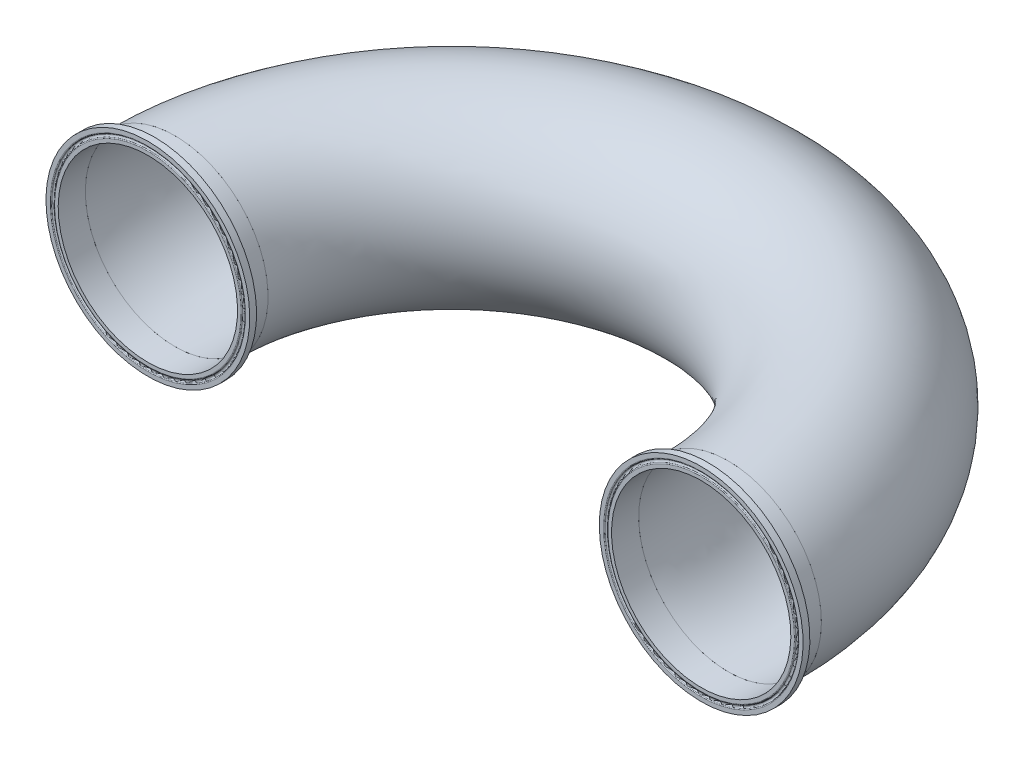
ISO-10303-21;
HEADER;
FILE_DESCRIPTION(('STEP AP214'),'2;1');
FILE_NAME('part.step','',(''),(''),'','','');
FILE_SCHEMA(('AUTOMOTIVE_DESIGN { 1 0 10303 214 1 1 1 1 }'));
ENDSEC;
DATA;
#1=APPLICATION_CONTEXT('core data for automotive mechanical design processes');
#2=APPLICATION_PROTOCOL_DEFINITION('international standard','automotive_design',2000,#1);
#3=PRODUCT_CONTEXT('',#1,'mechanical');
#4=PRODUCT('Part','Part','',(#3));
#5=PRODUCT_RELATED_PRODUCT_CATEGORY('part','',(#4));
#6=PRODUCT_DEFINITION_FORMATION('','',#4);
#7=PRODUCT_DEFINITION_CONTEXT('part definition',#1,'design');
#8=PRODUCT_DEFINITION('design','',#6,#7);
#9=PRODUCT_DEFINITION_SHAPE('','',#8);
#10=(LENGTH_UNIT() NAMED_UNIT(*) SI_UNIT(.MILLI.,.METRE.));
#11=(NAMED_UNIT(*) PLANE_ANGLE_UNIT() SI_UNIT($,.RADIAN.));
#12=(NAMED_UNIT(*) SI_UNIT($,.STERADIAN.) SOLID_ANGLE_UNIT());
#13=UNCERTAINTY_MEASURE_WITH_UNIT(LENGTH_MEASURE(1.E-05),#10,'distance_accuracy_value','');
#14=(GEOMETRIC_REPRESENTATION_CONTEXT(3) GLOBAL_UNCERTAINTY_ASSIGNED_CONTEXT((#13)) GLOBAL_UNIT_ASSIGNED_CONTEXT((#10,
#11,#12)) REPRESENTATION_CONTEXT('',''));
#15=CARTESIAN_POINT('',(0.,0.,0.));
#16=DIRECTION('',(0.,0.,1.));
#17=DIRECTION('',(1.,0.,0.));
#18=AXIS2_PLACEMENT_3D('',#15,#16,#17);
#19=CARTESIAN_POINT('',(404.929578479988,271.760676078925,429.773011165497));
#20=DIRECTION('',(0.,0.,0.999999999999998));
#21=DIRECTION('',(0.727243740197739,-0.686379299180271,0.));
#22=AXIS2_PLACEMENT_3D('',#19,#20,#21);
#23=TOROIDAL_SURFACE('',#22,79.9992084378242,0.787400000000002);
#24=CARTESIAN_POINT('',(404.929578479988,271.760676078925,430.560411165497));
#25=DIRECTION('',(0.,0.,0.999999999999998));
#26=DIRECTION('',(0.727243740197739,-0.686379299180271,0.));
#27=AXIS2_PLACEMENT_3D('',#24,#25,#26);
#28=CIRCLE('',#27,79.9992084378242);
#29=CARTESIAN_POINT('',(463.10850203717,216.850875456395,430.560411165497));
#30=VERTEX_POINT('',#29);
#31=EDGE_CURVE('P0_E48',#30,#30,#28,.T.);
#32=ORIENTED_EDGE('',*,*,#31,.T.);
#33=EDGE_LOOP('',(#32));
#34=FACE_BOUND('',#33,.T.);
#35=CARTESIAN_POINT('',(404.929578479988,271.760676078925,430.085952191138));
#36=DIRECTION('',(0.,0.,0.999999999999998));
#37=DIRECTION('',(0.727243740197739,-0.686379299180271,0.));
#38=AXIS2_PLACEMENT_3D('',#35,#36,#37);
#39=CIRCLE('',#38,79.2766666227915);
#40=CARTESIAN_POINT('',(462.583038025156,217.346813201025,430.085952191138));
#41=VERTEX_POINT('',#40);
#42=EDGE_CURVE('P0_E9',#41,#41,#39,.T.);
#43=ORIENTED_EDGE('',*,*,#42,.F.);
#44=EDGE_LOOP('',(#43));
#45=FACE_BOUND('',#44,.T.);
#46=ADVANCED_FACE('P0_F14',(#34,#45),#23,.T.);
#47=CARTESIAN_POINT('',(404.929578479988,271.760676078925,430.560411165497));
#48=DIRECTION('',(0.,0.,0.999999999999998));
#49=DIRECTION('',(0.727243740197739,-0.686379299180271,0.));
#50=AXIS2_PLACEMENT_3D('',#47,#48,#49);
#51=TOROIDAL_SURFACE('',#50,78.1812,1.1938);
#52=CARTESIAN_POINT('',(404.929578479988,271.760676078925,430.085952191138));
#53=DIRECTION('',(0.,0.,0.999999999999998));
#54=DIRECTION('',(0.727243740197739,-0.686379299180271,0.));
#55=AXIS2_PLACEMENT_3D('',#52,#53,#54);
#56=CIRCLE('',#55,77.0857333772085);
#57=CARTESIAN_POINT('',(460.989695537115,218.850624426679,430.085952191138));
#58=VERTEX_POINT('',#57);
#59=EDGE_CURVE('P0_E20',#58,#58,#56,.T.);
#60=ORIENTED_EDGE('',*,*,#59,.F.);
#61=EDGE_LOOP('',(#60));
#62=FACE_BOUND('',#61,.T.);
#63=ORIENTED_EDGE('',*,*,#42,.T.);
#64=EDGE_LOOP('',(#63));
#65=FACE_BOUND('',#64,.T.);
#66=ADVANCED_FACE('P0_F97',(#62,#65),#51,.F.);
#67=CARTESIAN_POINT('',(404.929578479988,271.760676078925,429.773011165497));
#68=DIRECTION('',(0.,0.,0.999999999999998));
#69=DIRECTION('',(0.727243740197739,-0.686379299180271,0.));
#70=AXIS2_PLACEMENT_3D('',#67,#68,#69);
#71=TOROIDAL_SURFACE('',#70,76.3631915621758,0.787399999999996);
#72=ORIENTED_EDGE('',*,*,#59,.T.);
#73=EDGE_LOOP('',(#72));
#74=FACE_BOUND('',#73,.T.);
#75=CARTESIAN_POINT('',(404.929578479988,271.760676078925,430.560411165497));
#76=DIRECTION('',(0.,0.,0.999999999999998));
#77=DIRECTION('',(0.727243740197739,-0.686379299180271,0.));
#78=AXIS2_PLACEMENT_3D('',#75,#76,#77);
#79=CIRCLE('',#78,76.3631915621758);
#80=CARTESIAN_POINT('',(460.464231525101,219.34656217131,430.560411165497));
#81=VERTEX_POINT('',#80);
#82=EDGE_CURVE('P0_E24',#81,#81,#79,.T.);
#83=ORIENTED_EDGE('',*,*,#82,.F.);
#84=EDGE_LOOP('',(#83));
#85=FACE_BOUND('',#84,.T.);
#86=ADVANCED_FACE('P0_F93',(#74,#85),#71,.T.);
#87=CARTESIAN_POINT('',(404.929578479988,271.760676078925,430.560411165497));
#88=DIRECTION('',(0.,0.,-0.999999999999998));
#89=DIRECTION('',(-0.727243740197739,0.686379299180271,0.));
#90=AXIS2_PLACEMENT_3D('',#87,#88,#89);
#91=PLANE('',#90);
#92=CARTESIAN_POINT('',(404.929578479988,271.760676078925,430.560411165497));
#93=DIRECTION('',(0.,0.,0.999999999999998));
#94=DIRECTION('',(0.727243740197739,-0.686379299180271,0.));
#95=AXIS2_PLACEMENT_3D('',#92,#93,#94);
#96=CIRCLE('',#95,73.4314);
#97=CARTESIAN_POINT('',(458.332104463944,221.358883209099,430.560411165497));
#98=VERTEX_POINT('',#97);
#99=EDGE_CURVE('P0_E28',#98,#98,#96,.T.);
#100=ORIENTED_EDGE('',*,*,#99,.F.);
#101=EDGE_LOOP('',(#100));
#102=FACE_BOUND('',#101,.T.);
#103=ORIENTED_EDGE('',*,*,#82,.T.);
#104=EDGE_LOOP('',(#103));
#105=FACE_BOUND('',#104,.T.);
#106=ADVANCED_FACE('P0_F86',(#102,#105),#91,.F.);
#107=CARTESIAN_POINT('',(404.929578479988,271.760676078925,430.560411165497));
#108=DIRECTION('',(0.,0.,0.999999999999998));
#109=DIRECTION('',(0.727243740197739,-0.686379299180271,0.));
#110=AXIS2_PLACEMENT_3D('',#107,#108,#109);
#111=CYLINDRICAL_SURFACE('',#110,73.4314);
#112=CARTESIAN_POINT('',(404.929578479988,271.760676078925,408.335411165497));
#113=DIRECTION('',(0.,0.,0.999999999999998));
#114=DIRECTION('',(0.727243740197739,-0.686379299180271,0.));
#115=AXIS2_PLACEMENT_3D('',#112,#113,#114);
#116=CIRCLE('',#115,73.4314);
#117=CARTESIAN_POINT('',(458.332104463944,221.358883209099,408.335411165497));
#118=VERTEX_POINT('',#117);
#119=EDGE_CURVE('P0_E33',#118,#118,#116,.T.);
#120=CARTESIAN_POINT('',(458.332104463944,221.358883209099,430.560411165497));
#121=CARTESIAN_POINT('',(458.332104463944,221.358883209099,430.32890074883));
#122=CARTESIAN_POINT('',(458.332104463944,221.358883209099,430.097390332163));
#123=CARTESIAN_POINT('',(458.332104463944,221.358883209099,429.63436949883));
#124=CARTESIAN_POINT('',(458.332104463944,221.358883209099,429.402859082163));
#125=CARTESIAN_POINT('',(458.332104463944,221.358883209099,428.93983824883));
#126=CARTESIAN_POINT('',(458.332104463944,221.358883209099,428.708327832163));
#127=CARTESIAN_POINT('',(458.332104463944,221.358883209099,428.24530699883));
#128=CARTESIAN_POINT('',(458.332104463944,221.358883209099,428.013796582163));
#129=CARTESIAN_POINT('',(458.332104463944,221.358883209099,427.55077574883));
#130=CARTESIAN_POINT('',(458.332104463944,221.358883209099,427.319265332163));
#131=CARTESIAN_POINT('',(458.332104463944,221.358883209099,426.85624449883));
#132=CARTESIAN_POINT('',(458.332104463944,221.358883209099,426.624734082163));
#133=CARTESIAN_POINT('',(458.332104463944,221.358883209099,426.16171324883));
#134=CARTESIAN_POINT('',(458.332104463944,221.358883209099,425.930202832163));
#135=CARTESIAN_POINT('',(458.332104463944,221.358883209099,425.46718199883));
#136=CARTESIAN_POINT('',(458.332104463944,221.358883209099,425.235671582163));
#137=CARTESIAN_POINT('',(458.332104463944,221.358883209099,424.77265074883));
#138=CARTESIAN_POINT('',(458.332104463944,221.358883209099,424.541140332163));
#139=CARTESIAN_POINT('',(458.332104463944,221.358883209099,424.07811949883));
#140=CARTESIAN_POINT('',(458.332104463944,221.358883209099,423.846609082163));
#141=CARTESIAN_POINT('',(458.332104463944,221.358883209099,423.38358824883));
#142=CARTESIAN_POINT('',(458.332104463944,221.358883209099,423.152077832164));
#143=CARTESIAN_POINT('',(458.332104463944,221.358883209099,422.68905699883));
#144=CARTESIAN_POINT('',(458.332104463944,221.358883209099,422.457546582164));
#145=CARTESIAN_POINT('',(458.332104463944,221.358883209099,421.99452574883));
#146=CARTESIAN_POINT('',(458.332104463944,221.358883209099,421.763015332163));
#147=CARTESIAN_POINT('',(458.332104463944,221.358883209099,421.29999449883));
#148=CARTESIAN_POINT('',(458.332104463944,221.358883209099,421.068484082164));
#149=CARTESIAN_POINT('',(458.332104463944,221.358883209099,420.60546324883));
#150=CARTESIAN_POINT('',(458.332104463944,221.358883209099,420.373952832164));
#151=CARTESIAN_POINT('',(458.332104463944,221.358883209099,419.91093199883));
#152=CARTESIAN_POINT('',(458.332104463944,221.358883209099,419.679421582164));
#153=CARTESIAN_POINT('',(458.332104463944,221.358883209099,419.21640074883));
#154=CARTESIAN_POINT('',(458.332104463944,221.358883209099,418.984890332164));
#155=CARTESIAN_POINT('',(458.332104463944,221.358883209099,418.52186949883));
#156=CARTESIAN_POINT('',(458.332104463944,221.358883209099,418.290359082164));
#157=CARTESIAN_POINT('',(458.332104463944,221.358883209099,417.82733824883));
#158=CARTESIAN_POINT('',(458.332104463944,221.358883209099,417.595827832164));
#159=CARTESIAN_POINT('',(458.332104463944,221.358883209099,417.13280699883));
#160=CARTESIAN_POINT('',(458.332104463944,221.358883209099,416.901296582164));
#161=CARTESIAN_POINT('',(458.332104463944,221.358883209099,416.43827574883));
#162=CARTESIAN_POINT('',(458.332104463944,221.358883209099,416.206765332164));
#163=CARTESIAN_POINT('',(458.332104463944,221.358883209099,415.74374449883));
#164=CARTESIAN_POINT('',(458.332104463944,221.358883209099,415.512234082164));
#165=CARTESIAN_POINT('',(458.332104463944,221.358883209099,415.04921324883));
#166=CARTESIAN_POINT('',(458.332104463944,221.358883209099,414.817702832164));
#167=CARTESIAN_POINT('',(458.332104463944,221.358883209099,414.35468199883));
#168=CARTESIAN_POINT('',(458.332104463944,221.358883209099,414.123171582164));
#169=CARTESIAN_POINT('',(458.332104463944,221.358883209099,413.66015074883));
#170=CARTESIAN_POINT('',(458.332104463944,221.358883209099,413.428640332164));
#171=CARTESIAN_POINT('',(458.332104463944,221.358883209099,412.96561949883));
#172=CARTESIAN_POINT('',(458.332104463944,221.358883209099,412.734109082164));
#173=CARTESIAN_POINT('',(458.332104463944,221.358883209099,412.27108824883));
#174=CARTESIAN_POINT('',(458.332104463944,221.358883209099,412.039577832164));
#175=CARTESIAN_POINT('',(458.332104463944,221.358883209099,411.57655699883));
#176=CARTESIAN_POINT('',(458.332104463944,221.358883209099,411.345046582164));
#177=CARTESIAN_POINT('',(458.332104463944,221.358883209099,410.88202574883));
#178=CARTESIAN_POINT('',(458.332104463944,221.358883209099,410.650515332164));
#179=CARTESIAN_POINT('',(458.332104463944,221.358883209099,410.18749449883));
#180=CARTESIAN_POINT('',(458.332104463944,221.358883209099,409.955984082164));
#181=CARTESIAN_POINT('',(458.332104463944,221.358883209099,409.49296324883));
#182=CARTESIAN_POINT('',(458.332104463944,221.358883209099,409.261452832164));
#183=CARTESIAN_POINT('',(458.332104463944,221.358883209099,408.79843199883));
#184=CARTESIAN_POINT('',(458.332104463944,221.358883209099,408.566921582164));
#185=CARTESIAN_POINT('',(458.332104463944,221.358883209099,408.335411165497));
#186=B_SPLINE_CURVE_WITH_KNOTS('',3,(#120,#121,#122,#123,#124,#125,#126,#127,#128,#129,#130,
#131,#132,#133,#134,#135,#136,#137,#138,#139,#140,#141,#142,#143,#144,#145,#146,#147,#148,#149,
#150,#151,#152,#153,#154,#155,#156,#157,#158,#159,#160,#161,#162,#163,#164,#165,#166,#167,#168,
#169,#170,#171,#172,#173,#174,#175,#176,#177,#178,#179,#180,#181,#182,#183,#184,#185),
.UNSPECIFIED.,.F.,.F.,(4,2,2,2,2,2,2,2,2,2,2,2,2,2,2,2,2,2,2,2,2,2,2,2,2,2,2,2,2,2,2,2,4),(0.,
0.694531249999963,1.38906249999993,2.08359374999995,2.77812499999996,3.47265624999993,
4.16718749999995,4.86171874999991,5.55624999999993,6.25078124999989,6.94531249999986,
7.63984374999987,8.33437499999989,9.02890624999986,9.72343749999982,10.4179687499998,
11.1124999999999,11.8070312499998,12.5015624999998,13.1960937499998,13.8906249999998,
14.5851562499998,15.2796874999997,15.9742187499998,16.6687499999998,17.3632812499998,
18.0578124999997,18.7523437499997,19.4468749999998,20.1414062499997,20.8359374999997,
21.5304687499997,22.2249999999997),.UNSPECIFIED.);
#187=EDGE_CURVE('P0_BSEAM81',#98,#118,#186,.T.);
#188=ORIENTED_EDGE('',*,*,#99,.T.);
#189=ORIENTED_EDGE('',*,*,#119,.F.);
#190=ORIENTED_EDGE('',*,*,#187,.T.);
#191=ORIENTED_EDGE('',*,*,#187,.F.);
#192=EDGE_LOOP('',(#188,#190,#189,#191));
#193=FACE_BOUND('',#192,.T.);
#194=ADVANCED_FACE('P0_F81',(#193),#111,.F.);
#195=CARTESIAN_POINT('',(404.929578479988,271.760676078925,408.335411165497));
#196=DIRECTION('',(0.,0.,0.999999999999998));
#197=DIRECTION('',(0.727243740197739,-0.686379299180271,0.));
#198=AXIS2_PLACEMENT_3D('',#195,#196,#197);
#199=PLANE('',#198);
#200=CARTESIAN_POINT('',(404.929578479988,271.760676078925,408.335411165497));
#201=DIRECTION('',(0.,0.,0.999999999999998));
#202=DIRECTION('',(0.727243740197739,-0.686379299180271,0.));
#203=AXIS2_PLACEMENT_3D('',#200,#201,#202);
#204=CIRCLE('',#203,76.2);
#205=CARTESIAN_POINT('',(460.345551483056,219.458573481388,408.335411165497));
#206=VERTEX_POINT('',#205);
#207=EDGE_CURVE('P0_E36',#206,#206,#204,.T.);
#208=ORIENTED_EDGE('',*,*,#207,.F.);
#209=EDGE_LOOP('',(#208));
#210=FACE_BOUND('',#209,.T.);
#211=ORIENTED_EDGE('',*,*,#119,.T.);
#212=EDGE_LOOP('',(#211));
#213=FACE_BOUND('',#212,.T.);
#214=ADVANCED_FACE('P0_F75',(#210,#213),#199,.F.);
#215=CARTESIAN_POINT('',(404.929578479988,271.760676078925,430.560411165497));
#216=DIRECTION('',(0.,0.,0.999999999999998));
#217=DIRECTION('',(0.727243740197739,-0.686379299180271,0.));
#218=AXIS2_PLACEMENT_3D('',#215,#216,#217);
#219=CYLINDRICAL_SURFACE('',#218,76.2);
#220=CARTESIAN_POINT('',(404.929578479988,271.760676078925,422.337630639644));
#221=DIRECTION('',(0.,0.,0.999999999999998));
#222=DIRECTION('',(0.727243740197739,-0.686379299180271,0.));
#223=AXIS2_PLACEMENT_3D('',#220,#221,#222);
#224=CIRCLE('',#223,76.2);
#225=CARTESIAN_POINT('',(460.345551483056,219.458573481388,422.337630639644));
#226=VERTEX_POINT('',#225);
#227=EDGE_CURVE('P0_E39',#226,#226,#224,.T.);
#228=CARTESIAN_POINT('',(460.345551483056,219.458573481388,422.337630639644));
#229=CARTESIAN_POINT('',(460.345551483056,219.458573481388,422.191774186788));
#230=CARTESIAN_POINT('',(460.345551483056,219.458573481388,422.045917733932));
#231=CARTESIAN_POINT('',(460.345551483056,219.458573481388,421.754204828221));
#232=CARTESIAN_POINT('',(460.345551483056,219.458573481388,421.608348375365));
#233=CARTESIAN_POINT('',(460.345551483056,219.458573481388,421.316635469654));
#234=CARTESIAN_POINT('',(460.345551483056,219.458573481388,421.170779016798));
#235=CARTESIAN_POINT('',(460.345551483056,219.458573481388,420.879066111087));
#236=CARTESIAN_POINT('',(460.345551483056,219.458573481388,420.733209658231));
#237=CARTESIAN_POINT('',(460.345551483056,219.458573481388,420.44149675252));
#238=CARTESIAN_POINT('',(460.345551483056,219.458573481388,420.295640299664));
#239=CARTESIAN_POINT('',(460.345551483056,219.458573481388,420.003927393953));
#240=CARTESIAN_POINT('',(460.345551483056,219.458573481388,419.858070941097));
#241=CARTESIAN_POINT('',(460.345551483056,219.458573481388,419.566358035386));
#242=CARTESIAN_POINT('',(460.345551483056,219.458573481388,419.42050158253));
#243=CARTESIAN_POINT('',(460.345551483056,219.458573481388,419.128788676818));
#244=CARTESIAN_POINT('',(460.345551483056,219.458573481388,418.982932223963));
#245=CARTESIAN_POINT('',(460.345551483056,219.458573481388,418.691219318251));
#246=CARTESIAN_POINT('',(460.345551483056,219.458573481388,418.545362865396));
#247=CARTESIAN_POINT('',(460.345551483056,219.458573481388,418.253649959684));
#248=CARTESIAN_POINT('',(460.345551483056,219.458573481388,418.107793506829));
#249=CARTESIAN_POINT('',(460.345551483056,219.458573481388,417.816080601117));
#250=CARTESIAN_POINT('',(460.345551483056,219.458573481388,417.670224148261));
#251=CARTESIAN_POINT('',(460.345551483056,219.458573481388,417.37851124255));
#252=CARTESIAN_POINT('',(460.345551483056,219.458573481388,417.232654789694));
#253=CARTESIAN_POINT('',(460.345551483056,219.458573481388,416.940941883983));
#254=CARTESIAN_POINT('',(460.345551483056,219.458573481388,416.795085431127));
#255=CARTESIAN_POINT('',(460.345551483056,219.458573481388,416.503372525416));
#256=CARTESIAN_POINT('',(460.345551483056,219.458573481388,416.35751607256));
#257=CARTESIAN_POINT('',(460.345551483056,219.458573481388,416.065803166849));
#258=CARTESIAN_POINT('',(460.345551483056,219.458573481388,415.919946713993));
#259=CARTESIAN_POINT('',(460.345551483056,219.458573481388,415.628233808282));
#260=CARTESIAN_POINT('',(460.345551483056,219.458573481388,415.482377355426));
#261=CARTESIAN_POINT('',(460.345551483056,219.458573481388,415.190664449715));
#262=CARTESIAN_POINT('',(460.345551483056,219.458573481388,415.044807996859));
#263=CARTESIAN_POINT('',(460.345551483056,219.458573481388,414.753095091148));
#264=CARTESIAN_POINT('',(460.345551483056,219.458573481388,414.607238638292));
#265=CARTESIAN_POINT('',(460.345551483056,219.458573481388,414.315525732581));
#266=CARTESIAN_POINT('',(460.345551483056,219.458573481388,414.169669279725));
#267=CARTESIAN_POINT('',(460.345551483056,219.458573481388,413.877956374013));
#268=CARTESIAN_POINT('',(460.345551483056,219.458573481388,413.732099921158));
#269=CARTESIAN_POINT('',(460.345551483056,219.458573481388,413.440387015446));
#270=CARTESIAN_POINT('',(460.345551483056,219.458573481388,413.294530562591));
#271=CARTESIAN_POINT('',(460.345551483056,219.458573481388,413.002817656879));
#272=CARTESIAN_POINT('',(460.345551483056,219.458573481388,412.856961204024));
#273=CARTESIAN_POINT('',(460.345551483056,219.458573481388,412.565248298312));
#274=CARTESIAN_POINT('',(460.345551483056,219.458573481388,412.419391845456));
#275=CARTESIAN_POINT('',(460.345551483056,219.458573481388,412.127678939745));
#276=CARTESIAN_POINT('',(460.345551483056,219.458573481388,411.981822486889));
#277=CARTESIAN_POINT('',(460.345551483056,219.458573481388,411.690109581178));
#278=CARTESIAN_POINT('',(460.345551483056,219.458573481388,411.544253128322));
#279=CARTESIAN_POINT('',(460.345551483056,219.458573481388,411.252540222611));
#280=CARTESIAN_POINT('',(460.345551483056,219.458573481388,411.106683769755));
#281=CARTESIAN_POINT('',(460.345551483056,219.458573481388,410.814970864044));
#282=CARTESIAN_POINT('',(460.345551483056,219.458573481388,410.669114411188));
#283=CARTESIAN_POINT('',(460.345551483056,219.458573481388,410.377401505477));
#284=CARTESIAN_POINT('',(460.345551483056,219.458573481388,410.231545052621));
#285=CARTESIAN_POINT('',(460.345551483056,219.458573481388,409.93983214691));
#286=CARTESIAN_POINT('',(460.345551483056,219.458573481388,409.793975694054));
#287=CARTESIAN_POINT('',(460.345551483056,219.458573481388,409.502262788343));
#288=CARTESIAN_POINT('',(460.345551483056,219.458573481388,409.356406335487));
#289=CARTESIAN_POINT('',(460.345551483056,219.458573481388,409.064693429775));
#290=CARTESIAN_POINT('',(460.345551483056,219.458573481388,408.91883697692));
#291=CARTESIAN_POINT('',(460.345551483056,219.458573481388,408.627124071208));
#292=CARTESIAN_POINT('',(460.345551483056,219.458573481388,408.481267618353));
#293=CARTESIAN_POINT('',(460.345551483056,219.458573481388,408.335411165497));
#294=B_SPLINE_CURVE_WITH_KNOTS('',3,(#228,#229,#230,#231,#232,#233,#234,#235,#236,#237,#238,
#239,#240,#241,#242,#243,#244,#245,#246,#247,#248,#249,#250,#251,#252,#253,#254,#255,#256,#257,
#258,#259,#260,#261,#262,#263,#264,#265,#266,#267,#268,#269,#270,#271,#272,#273,#274,#275,#276,
#277,#278,#279,#280,#281,#282,#283,#284,#285,#286,#287,#288,#289,#290,#291,#292,#293),
.UNSPECIFIED.,.F.,.F.,(4,2,2,2,2,2,2,2,2,2,2,2,2,2,2,2,2,2,2,2,2,2,2,2,2,2,2,2,2,2,2,2,4),(0.,
0.437569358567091,0.875138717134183,1.31270807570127,1.75027743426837,2.18784679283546,
2.62541615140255,3.06298550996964,3.50055486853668,3.93812422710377,4.37569358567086,
4.81326294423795,5.25083230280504,5.68840166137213,6.12597101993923,6.56354037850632,
7.00110973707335,7.43867909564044,7.87624845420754,8.31381781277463,8.75138717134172,
9.18895652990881,9.6265258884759,10.064095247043,10.50166460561,10.9392339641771,
11.3768033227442,11.8143726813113,12.2519420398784,12.6895113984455,13.1270807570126,
13.5646501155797,14.0022194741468),.UNSPECIFIED.);
#295=EDGE_CURVE('P0_BSEAM69',#226,#206,#294,.T.);
#296=ORIENTED_EDGE('',*,*,#227,.F.);
#297=ORIENTED_EDGE('',*,*,#207,.T.);
#298=ORIENTED_EDGE('',*,*,#295,.T.);
#299=ORIENTED_EDGE('',*,*,#295,.F.);
#300=EDGE_LOOP('',(#296,#298,#297,#299));
#301=FACE_BOUND('',#300,.T.);
#302=ADVANCED_FACE('P0_F69',(#301),#219,.T.);
#303=CARTESIAN_POINT('',(404.929578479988,271.760676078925,422.337630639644));
#304=DIRECTION('',(0.,0.,0.999999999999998));
#305=DIRECTION('',(0.727243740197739,-0.686379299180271,0.));
#306=AXIS2_PLACEMENT_3D('',#303,#304,#305);
#307=CONICAL_SURFACE('',#306,76.2,1.22173047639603);
#308=CARTESIAN_POINT('',(404.929578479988,271.760676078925,424.972411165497));
#309=DIRECTION('',(0.,0.,0.999999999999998));
#310=DIRECTION('',(0.727243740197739,-0.686379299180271,0.));
#311=AXIS2_PLACEMENT_3D('',#308,#309,#310);
#312=CIRCLE('',#311,83.439);
#313=CARTESIAN_POINT('',(465.610068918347,214.489873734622,424.972411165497));
#314=VERTEX_POINT('',#313);
#315=EDGE_CURVE('P0_E42',#314,#314,#312,.T.);
#316=CARTESIAN_POINT('',(465.610068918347,214.489873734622,424.972411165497));
#317=CARTESIAN_POINT('',(465.555230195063,214.541631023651,424.944965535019));
#318=CARTESIAN_POINT('',(465.500391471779,214.59338831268,424.917519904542));
#319=CARTESIAN_POINT('',(465.39071402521,214.696902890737,424.862628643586));
#320=CARTESIAN_POINT('',(465.335875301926,214.748660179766,424.835183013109));
#321=CARTESIAN_POINT('',(465.226197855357,214.852174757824,424.780291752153));
#322=CARTESIAN_POINT('',(465.171359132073,214.903932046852,424.752846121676));
#323=CARTESIAN_POINT('',(465.061681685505,215.00744662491,424.69795486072));
#324=CARTESIAN_POINT('',(465.00684296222,215.059203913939,424.670509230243));
#325=CARTESIAN_POINT('',(464.897165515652,215.162718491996,424.615617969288));
#326=CARTESIAN_POINT('',(464.842326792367,215.214475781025,424.58817233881));
#327=CARTESIAN_POINT('',(464.732649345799,215.317990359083,424.533281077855));
#328=CARTESIAN_POINT('',(464.677810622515,215.369747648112,424.505835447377));
#329=CARTESIAN_POINT('',(464.568133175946,215.473262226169,424.450944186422));
#330=CARTESIAN_POINT('',(464.513294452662,215.525019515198,424.423498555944));
#331=CARTESIAN_POINT('',(464.403617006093,215.628534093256,424.368607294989));
#332=CARTESIAN_POINT('',(464.348778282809,215.680291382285,424.341161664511));
#333=CARTESIAN_POINT('',(464.23910083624,215.783805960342,424.286270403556));
#334=CARTESIAN_POINT('',(464.184262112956,215.835563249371,424.258824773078));
#335=CARTESIAN_POINT('',(464.074584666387,215.939077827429,424.203933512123));
#336=CARTESIAN_POINT('',(464.019745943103,215.990835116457,424.176487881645));
#337=CARTESIAN_POINT('',(463.910068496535,216.094349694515,424.12159662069));
#338=CARTESIAN_POINT('',(463.85522977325,216.146106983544,424.094150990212));
#339=CARTESIAN_POINT('',(463.745552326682,216.249621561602,424.039259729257));
#340=CARTESIAN_POINT('',(463.690713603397,216.30137885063,424.01181409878));
#341=CARTESIAN_POINT('',(463.581036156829,216.404893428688,423.956922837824));
#342=CARTESIAN_POINT('',(463.526197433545,216.456650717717,423.929477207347));
#343=CARTESIAN_POINT('',(463.416519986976,216.560165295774,423.874585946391));
#344=CARTESIAN_POINT('',(463.361681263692,216.611922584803,423.847140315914));
#345=CARTESIAN_POINT('',(463.252003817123,216.715437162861,423.792249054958));
#346=CARTESIAN_POINT('',(463.197165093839,216.76719445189,423.764803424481));
#347=CARTESIAN_POINT('',(463.08748764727,216.870709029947,423.709912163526));
#348=CARTESIAN_POINT('',(463.032648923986,216.922466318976,423.682466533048));
#349=CARTESIAN_POINT('',(462.922971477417,217.025980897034,423.627575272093));
#350=CARTESIAN_POINT('',(462.868132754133,217.077738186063,423.600129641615));
#351=CARTESIAN_POINT('',(462.758455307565,217.18125276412,423.54523838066));
#352=CARTESIAN_POINT('',(462.70361658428,217.233010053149,423.517792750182));
#353=CARTESIAN_POINT('',(462.593939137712,217.336524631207,423.462901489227));
#354=CARTESIAN_POINT('',(462.539100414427,217.388281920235,423.435455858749));
#355=CARTESIAN_POINT('',(462.429422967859,217.491796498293,423.380564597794));
#356=CARTESIAN_POINT('',(462.374584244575,217.543553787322,423.353118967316));
#357=CARTESIAN_POINT('',(462.264906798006,217.64706836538,423.298227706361));
#358=CARTESIAN_POINT('',(462.210068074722,217.698825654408,423.270782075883));
#359=CARTESIAN_POINT('',(462.100390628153,217.802340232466,423.215890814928));
#360=CARTESIAN_POINT('',(462.045551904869,217.854097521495,423.18844518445));
#361=CARTESIAN_POINT('',(461.9358744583,217.957612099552,423.133553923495));
#362=CARTESIAN_POINT('',(461.881035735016,218.009369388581,423.106108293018));
#363=CARTESIAN_POINT('',(461.771358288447,218.112883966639,423.051217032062));
#364=CARTESIAN_POINT('',(461.716519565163,218.164641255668,423.023771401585));
#365=CARTESIAN_POINT('',(461.606842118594,218.268155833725,422.968880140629));
#366=CARTESIAN_POINT('',(461.55200339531,218.319913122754,422.941434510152));
#367=CARTESIAN_POINT('',(461.442325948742,218.423427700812,422.886543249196));
#368=CARTESIAN_POINT('',(461.387487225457,218.475184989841,422.859097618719));
#369=CARTESIAN_POINT('',(461.277809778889,218.578699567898,422.804206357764));
#370=CARTESIAN_POINT('',(461.222971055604,218.630456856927,422.776760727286));
#371=CARTESIAN_POINT('',(461.113293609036,218.733971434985,422.721869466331));
#372=CARTESIAN_POINT('',(461.058454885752,218.785728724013,422.694423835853));
#373=CARTESIAN_POINT('',(460.948777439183,218.889243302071,422.639532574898));
#374=CARTESIAN_POINT('',(460.893938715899,218.9410005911,422.61208694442));
#375=CARTESIAN_POINT('',(460.78426126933,219.044515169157,422.557195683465));
#376=CARTESIAN_POINT('',(460.729422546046,219.096272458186,422.529750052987));
#377=CARTESIAN_POINT('',(460.619745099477,219.199787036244,422.474858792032));
#378=CARTESIAN_POINT('',(460.564906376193,219.251544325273,422.447413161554));
#379=CARTESIAN_POINT('',(460.455228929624,219.35505890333,422.392521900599));
#380=CARTESIAN_POINT('',(460.40039020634,219.406816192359,422.365076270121));
#381=CARTESIAN_POINT('',(460.345551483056,219.458573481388,422.337630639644));
#382=B_SPLINE_CURVE_WITH_KNOTS('',3,(#316,#317,#318,#319,#320,#321,#322,#323,#324,#325,#326,
#327,#328,#329,#330,#331,#332,#333,#334,#335,#336,#337,#338,#339,#340,#341,#342,#343,#344,#345,
#346,#347,#348,#349,#350,#351,#352,#353,#354,#355,#356,#357,#358,#359,#360,#361,#362,#363,#364,
#365,#366,#367,#368,#369,#370,#371,#372,#373,#374,#375,#376,#377,#378,#379,#380,#381),
.UNSPECIFIED.,.F.,.F.,(4,2,2,2,2,2,2,2,2,2,2,2,2,2,2,2,2,2,2,2,2,2,2,2,2,2,2,2,2,2,2,2,4),(0.,
0.240736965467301,0.481473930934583,0.722210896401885,0.962947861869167,1.20368482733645,
1.44442179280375,1.68515875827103,1.9258957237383,2.16663268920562,2.40736965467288,
2.6481066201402,2.88884358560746,3.12958055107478,3.37031751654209,3.61105448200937,
3.85179144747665,4.09252841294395,4.33326537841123,4.57400234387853,4.81473930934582,
5.0554762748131,5.2962132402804,5.53695020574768,5.77768717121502,6.0184241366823,
6.25916110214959,6.49989806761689,6.74063503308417,6.98137199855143,7.22210896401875,
7.46284592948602,7.70358289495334),.UNSPECIFIED.);
#383=EDGE_CURVE('P0_BSEAM63',#314,#226,#382,.T.);
#384=ORIENTED_EDGE('',*,*,#315,.F.);
#385=ORIENTED_EDGE('',*,*,#227,.T.);
#386=ORIENTED_EDGE('',*,*,#383,.T.);
#387=ORIENTED_EDGE('',*,*,#383,.F.);
#388=EDGE_LOOP('',(#384,#386,#385,#387));
#389=FACE_BOUND('',#388,.T.);
#390=ADVANCED_FACE('P0_F63',(#389),#307,.T.);
#391=CARTESIAN_POINT('',(404.929578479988,271.760676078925,430.560411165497));
#392=DIRECTION('',(0.,0.,0.999999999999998));
#393=DIRECTION('',(0.727243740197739,-0.686379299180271,0.));
#394=AXIS2_PLACEMENT_3D('',#391,#392,#393);
#395=CYLINDRICAL_SURFACE('',#394,83.439);
#396=CARTESIAN_POINT('',(404.929578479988,271.760676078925,430.560411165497));
#397=DIRECTION('',(0.,0.,0.999999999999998));
#398=DIRECTION('',(0.727243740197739,-0.686379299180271,0.));
#399=AXIS2_PLACEMENT_3D('',#396,#397,#398);
#400=CIRCLE('',#399,83.439);
#401=CARTESIAN_POINT('',(465.610068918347,214.489873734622,430.560411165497));
#402=VERTEX_POINT('',#401);
#403=EDGE_CURVE('P0_E45',#402,#402,#400,.T.);
#404=CARTESIAN_POINT('',(465.610068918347,214.489873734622,430.560411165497));
#405=CARTESIAN_POINT('',(465.610068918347,214.489873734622,430.502202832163));
#406=CARTESIAN_POINT('',(465.610068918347,214.489873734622,430.44399449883));
#407=CARTESIAN_POINT('',(465.610068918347,214.489873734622,430.327577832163));
#408=CARTESIAN_POINT('',(465.610068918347,214.489873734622,430.26936949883));
#409=CARTESIAN_POINT('',(465.610068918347,214.489873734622,430.152952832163));
#410=CARTESIAN_POINT('',(465.610068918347,214.489873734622,430.09474449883));
#411=CARTESIAN_POINT('',(465.610068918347,214.489873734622,429.978327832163));
#412=CARTESIAN_POINT('',(465.610068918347,214.489873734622,429.92011949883));
#413=CARTESIAN_POINT('',(465.610068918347,214.489873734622,429.803702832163));
#414=CARTESIAN_POINT('',(465.610068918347,214.489873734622,429.74549449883));
#415=CARTESIAN_POINT('',(465.610068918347,214.489873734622,429.629077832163));
#416=CARTESIAN_POINT('',(465.610068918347,214.489873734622,429.57086949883));
#417=CARTESIAN_POINT('',(465.610068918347,214.489873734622,429.454452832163));
#418=CARTESIAN_POINT('',(465.610068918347,214.489873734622,429.39624449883));
#419=CARTESIAN_POINT('',(465.610068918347,214.489873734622,429.279827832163));
#420=CARTESIAN_POINT('',(465.610068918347,214.489873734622,429.22161949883));
#421=CARTESIAN_POINT('',(465.610068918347,214.489873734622,429.105202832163));
#422=CARTESIAN_POINT('',(465.610068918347,214.489873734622,429.04699449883));
#423=CARTESIAN_POINT('',(465.610068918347,214.489873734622,428.930577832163));
#424=CARTESIAN_POINT('',(465.610068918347,214.489873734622,428.87236949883));
#425=CARTESIAN_POINT('',(465.610068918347,214.489873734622,428.755952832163));
#426=CARTESIAN_POINT('',(465.610068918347,214.489873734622,428.69774449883));
#427=CARTESIAN_POINT('',(465.610068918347,214.489873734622,428.581327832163));
#428=CARTESIAN_POINT('',(465.610068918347,214.489873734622,428.52311949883));
#429=CARTESIAN_POINT('',(465.610068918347,214.489873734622,428.406702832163));
#430=CARTESIAN_POINT('',(465.610068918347,214.489873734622,428.34849449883));
#431=CARTESIAN_POINT('',(465.610068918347,214.489873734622,428.232077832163));
#432=CARTESIAN_POINT('',(465.610068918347,214.489873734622,428.17386949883));
#433=CARTESIAN_POINT('',(465.610068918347,214.489873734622,428.057452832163));
#434=CARTESIAN_POINT('',(465.610068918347,214.489873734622,427.99924449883));
#435=CARTESIAN_POINT('',(465.610068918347,214.489873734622,427.882827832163));
#436=CARTESIAN_POINT('',(465.610068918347,214.489873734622,427.82461949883));
#437=CARTESIAN_POINT('',(465.610068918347,214.489873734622,427.708202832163));
#438=CARTESIAN_POINT('',(465.610068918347,214.489873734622,427.64999449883));
#439=CARTESIAN_POINT('',(465.610068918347,214.489873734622,427.533577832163));
#440=CARTESIAN_POINT('',(465.610068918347,214.489873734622,427.47536949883));
#441=CARTESIAN_POINT('',(465.610068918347,214.489873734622,427.358952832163));
#442=CARTESIAN_POINT('',(465.610068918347,214.489873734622,427.30074449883));
#443=CARTESIAN_POINT('',(465.610068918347,214.489873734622,427.184327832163));
#444=CARTESIAN_POINT('',(465.610068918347,214.489873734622,427.12611949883));
#445=CARTESIAN_POINT('',(465.610068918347,214.489873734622,427.009702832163));
#446=CARTESIAN_POINT('',(465.610068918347,214.489873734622,426.95149449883));
#447=CARTESIAN_POINT('',(465.610068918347,214.489873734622,426.835077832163));
#448=CARTESIAN_POINT('',(465.610068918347,214.489873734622,426.77686949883));
#449=CARTESIAN_POINT('',(465.610068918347,214.489873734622,426.660452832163));
#450=CARTESIAN_POINT('',(465.610068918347,214.489873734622,426.60224449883));
#451=CARTESIAN_POINT('',(465.610068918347,214.489873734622,426.485827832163));
#452=CARTESIAN_POINT('',(465.610068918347,214.489873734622,426.42761949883));
#453=CARTESIAN_POINT('',(465.610068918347,214.489873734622,426.311202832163));
#454=CARTESIAN_POINT('',(465.610068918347,214.489873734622,426.25299449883));
#455=CARTESIAN_POINT('',(465.610068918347,214.489873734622,426.136577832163));
#456=CARTESIAN_POINT('',(465.610068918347,214.489873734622,426.07836949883));
#457=CARTESIAN_POINT('',(465.610068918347,214.489873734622,425.961952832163));
#458=CARTESIAN_POINT('',(465.610068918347,214.489873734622,425.90374449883));
#459=CARTESIAN_POINT('',(465.610068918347,214.489873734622,425.787327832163));
#460=CARTESIAN_POINT('',(465.610068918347,214.489873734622,425.72911949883));
#461=CARTESIAN_POINT('',(465.610068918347,214.489873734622,425.612702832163));
#462=CARTESIAN_POINT('',(465.610068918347,214.489873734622,425.55449449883));
#463=CARTESIAN_POINT('',(465.610068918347,214.489873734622,425.438077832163));
#464=CARTESIAN_POINT('',(465.610068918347,214.489873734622,425.37986949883));
#465=CARTESIAN_POINT('',(465.610068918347,214.489873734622,425.263452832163));
#466=CARTESIAN_POINT('',(465.610068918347,214.489873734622,425.20524449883));
#467=CARTESIAN_POINT('',(465.610068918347,214.489873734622,425.088827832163));
#468=CARTESIAN_POINT('',(465.610068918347,214.489873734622,425.03061949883));
#469=CARTESIAN_POINT('',(465.610068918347,214.489873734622,424.972411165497));
#470=B_SPLINE_CURVE_WITH_KNOTS('',3,(#404,#405,#406,#407,#408,#409,#410,#411,#412,#413,#414,
#415,#416,#417,#418,#419,#420,#421,#422,#423,#424,#425,#426,#427,#428,#429,#430,#431,#432,#433,
#434,#435,#436,#437,#438,#439,#440,#441,#442,#443,#444,#445,#446,#447,#448,#449,#450,#451,#452,
#453,#454,#455,#456,#457,#458,#459,#460,#461,#462,#463,#464,#465,#466,#467,#468,#469),
.UNSPECIFIED.,.F.,.F.,(4,2,2,2,2,2,2,2,2,2,2,2,2,2,2,2,2,2,2,2,2,2,2,2,2,2,2,2,2,2,2,2,4),(0.,
0.174624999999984,0.349249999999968,0.523874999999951,0.698499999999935,0.873124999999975,
1.04774999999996,1.22237499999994,1.39699999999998,1.57162499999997,1.74624999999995,
1.92087499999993,2.09549999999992,2.27012499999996,2.44474999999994,2.61937499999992,
2.79399999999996,2.96862499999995,3.14324999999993,3.31787499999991,3.4924999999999,
3.66712499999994,3.84174999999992,4.01637499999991,4.19099999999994,4.36562499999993,
4.54024999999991,4.7148749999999,4.88949999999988,5.06412499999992,5.2387499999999,
5.41337499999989,5.58799999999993),.UNSPECIFIED.);
#471=EDGE_CURVE('P0_BSEAM57',#402,#314,#470,.T.);
#472=ORIENTED_EDGE('',*,*,#403,.F.);
#473=ORIENTED_EDGE('',*,*,#315,.T.);
#474=ORIENTED_EDGE('',*,*,#471,.T.);
#475=ORIENTED_EDGE('',*,*,#471,.F.);
#476=EDGE_LOOP('',(#472,#474,#473,#475));
#477=FACE_BOUND('',#476,.T.);
#478=ADVANCED_FACE('P0_F57',(#477),#395,.T.);
#479=CARTESIAN_POINT('',(404.929578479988,271.760676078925,430.560411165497));
#480=DIRECTION('',(0.,0.,-0.999999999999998));
#481=DIRECTION('',(-0.727243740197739,0.686379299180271,0.));
#482=AXIS2_PLACEMENT_3D('',#479,#480,#481);
#483=PLANE('',#482);
#484=ORIENTED_EDGE('',*,*,#31,.F.);
#485=EDGE_LOOP('',(#484));
#486=FACE_BOUND('',#485,.T.);
#487=ORIENTED_EDGE('',*,*,#403,.T.);
#488=EDGE_LOOP('',(#487));
#489=FACE_BOUND('',#488,.T.);
#490=ADVANCED_FACE('P0_F54',(#486,#489),#483,.F.);
#491=CLOSED_SHELL('',(#46,#66,#86,#106,#194,#214,#302,#390,#478,#490));
#492=MANIFOLD_SOLID_BREP('P0_B1',#491);
#493=CARTESIAN_POINT('',(-52.2521054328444,271.760676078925,425.68059200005));
#494=DIRECTION('',(0.,0.,0.999999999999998));
#495=DIRECTION('',(0.903809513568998,-0.427934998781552,0.));
#496=AXIS2_PLACEMENT_3D('',#493,#494,#495);
#497=TOROIDAL_SURFACE('',#496,79.9992084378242,0.787400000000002);
#498=CARTESIAN_POINT('',(-52.2521054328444,271.760676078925,426.46799200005));
#499=DIRECTION('',(0.,0.,0.999999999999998));
#500=DIRECTION('',(0.903809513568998,-0.427934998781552,0.));
#501=AXIS2_PLACEMENT_3D('',#498,#499,#500);
#502=CIRCLE('',#501,79.9992084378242);
#503=CARTESIAN_POINT('',(20.0519402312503,237.526214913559,426.467992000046));
#504=VERTEX_POINT('',#503);
#505=EDGE_CURVE('P1_E49',#504,#504,#502,.T.);
#506=ORIENTED_EDGE('',*,*,#505,.T.);
#507=EDGE_LOOP('',(#506));
#508=FACE_BOUND('',#507,.T.);
#509=CARTESIAN_POINT('',(-52.2521054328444,271.760676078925,425.993533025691));
#510=DIRECTION('',(0.,0.,0.999999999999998));
#511=DIRECTION('',(0.903809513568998,-0.427934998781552,0.));
#512=AXIS2_PLACEMENT_3D('',#509,#510,#511);
#513=CIRCLE('',#512,79.2766666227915);
#514=CARTESIAN_POINT('',(19.3989000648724,237.835415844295,425.993533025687));
#515=VERTEX_POINT('',#514);
#516=EDGE_CURVE('P1_E10',#515,#515,#513,.T.);
#517=ORIENTED_EDGE('',*,*,#516,.F.);
#518=EDGE_LOOP('',(#517));
#519=FACE_BOUND('',#518,.T.);
#520=ADVANCED_FACE('P1_F15',(#508,#519),#497,.T.);
#521=CARTESIAN_POINT('',(-52.2521054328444,271.760676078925,426.46799200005));
#522=DIRECTION('',(0.,0.,0.999999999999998));
#523=DIRECTION('',(0.903809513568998,-0.427934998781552,0.));
#524=AXIS2_PLACEMENT_3D('',#521,#522,#523);
#525=TOROIDAL_SURFACE('',#524,78.1812,1.1938);
#526=CARTESIAN_POINT('',(-52.2521054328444,271.760676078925,425.993533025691));
#527=DIRECTION('',(0.,0.,0.999999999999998));
#528=DIRECTION('',(0.903809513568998,-0.427934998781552,0.));
#529=AXIS2_PLACEMENT_3D('',#526,#527,#528);
#530=CIRCLE('',#529,77.0857333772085);
#531=CARTESIAN_POINT('',(17.4187137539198,238.772992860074,425.993533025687));
#532=VERTEX_POINT('',#531);
#533=EDGE_CURVE('P1_E21',#532,#532,#530,.T.);
#534=ORIENTED_EDGE('',*,*,#533,.F.);
#535=EDGE_LOOP('',(#534));
#536=FACE_BOUND('',#535,.T.);
#537=ORIENTED_EDGE('',*,*,#516,.T.);
#538=EDGE_LOOP('',(#537));
#539=FACE_BOUND('',#538,.T.);
#540=ADVANCED_FACE('P1_F98',(#536,#539),#525,.F.);
#541=CARTESIAN_POINT('',(-52.2521054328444,271.760676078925,425.68059200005));
#542=DIRECTION('',(0.,0.,0.999999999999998));
#543=DIRECTION('',(0.903809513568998,-0.427934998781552,0.));
#544=AXIS2_PLACEMENT_3D('',#541,#542,#543);
#545=TOROIDAL_SURFACE('',#544,76.3631915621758,0.787399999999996);
#546=ORIENTED_EDGE('',*,*,#533,.T.);
#547=EDGE_LOOP('',(#546));
#548=FACE_BOUND('',#547,.T.);
#549=CARTESIAN_POINT('',(-52.2521054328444,271.760676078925,426.46799200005));
#550=DIRECTION('',(0.,0.,0.999999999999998));
#551=DIRECTION('',(0.903809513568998,-0.427934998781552,0.));
#552=AXIS2_PLACEMENT_3D('',#549,#550,#551);
#553=CIRCLE('',#552,76.3631915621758);
#554=CARTESIAN_POINT('',(16.7656735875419,239.08219379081,426.467992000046));
#555=VERTEX_POINT('',#554);
#556=EDGE_CURVE('P1_E25',#555,#555,#553,.T.);
#557=ORIENTED_EDGE('',*,*,#556,.F.);
#558=EDGE_LOOP('',(#557));
#559=FACE_BOUND('',#558,.T.);
#560=ADVANCED_FACE('P1_F94',(#548,#559),#545,.T.);
#561=CARTESIAN_POINT('',(-52.2521054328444,271.760676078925,426.46799200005));
#562=DIRECTION('',(0.,0.,-0.999999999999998));
#563=DIRECTION('',(-0.903809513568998,0.427934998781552,0.));
#564=AXIS2_PLACEMENT_3D('',#561,#562,#563);
#565=PLANE('',#564);
#566=CARTESIAN_POINT('',(-52.2521054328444,271.760676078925,426.46799200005));
#567=DIRECTION('',(0.,0.,0.999999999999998));
#568=DIRECTION('',(0.903809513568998,-0.427934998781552,0.));
#569=AXIS2_PLACEMENT_3D('',#566,#567,#568);
#570=CIRCLE('',#569,73.4314);
#571=CARTESIAN_POINT('',(14.1158924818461,240.336810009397,426.467992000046));
#572=VERTEX_POINT('',#571);
#573=EDGE_CURVE('P1_E29',#572,#572,#570,.T.);
#574=ORIENTED_EDGE('',*,*,#573,.F.);
#575=EDGE_LOOP('',(#574));
#576=FACE_BOUND('',#575,.T.);
#577=ORIENTED_EDGE('',*,*,#556,.T.);
#578=EDGE_LOOP('',(#577));
#579=FACE_BOUND('',#578,.T.);
#580=ADVANCED_FACE('P1_F87',(#576,#579),#565,.F.);
#581=CARTESIAN_POINT('',(-52.2521054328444,271.760676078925,426.46799200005));
#582=DIRECTION('',(0.,0.,0.999999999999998));
#583=DIRECTION('',(0.903809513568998,-0.427934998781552,0.));
#584=AXIS2_PLACEMENT_3D('',#581,#582,#583);
#585=CYLINDRICAL_SURFACE('',#584,73.4314);
#586=CARTESIAN_POINT('',(-52.2521054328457,271.760676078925,404.242992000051));
#587=DIRECTION('',(0.,0.,0.999999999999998));
#588=DIRECTION('',(0.903809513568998,-0.427934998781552,0.));
#589=AXIS2_PLACEMENT_3D('',#586,#587,#588);
#590=CIRCLE('',#589,73.4314);
#591=CARTESIAN_POINT('',(14.1158924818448,240.336810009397,404.242992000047));
#592=VERTEX_POINT('',#591);
#593=EDGE_CURVE('P1_E34',#592,#592,#590,.T.);
#594=CARTESIAN_POINT('',(14.1158924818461,240.336810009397,426.467992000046));
#595=CARTESIAN_POINT('',(14.1158924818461,240.336810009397,426.23648158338));
#596=CARTESIAN_POINT('',(14.1158924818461,240.336810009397,426.004971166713));
#597=CARTESIAN_POINT('',(14.1158924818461,240.336810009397,425.54195033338));
#598=CARTESIAN_POINT('',(14.115892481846,240.336810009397,425.310439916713));
#599=CARTESIAN_POINT('',(14.115892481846,240.336810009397,424.84741908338));
#600=CARTESIAN_POINT('',(14.115892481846,240.336810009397,424.615908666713));
#601=CARTESIAN_POINT('',(14.115892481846,240.336810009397,424.15288783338));
#602=CARTESIAN_POINT('',(14.115892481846,240.336810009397,423.921377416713));
#603=CARTESIAN_POINT('',(14.1158924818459,240.336810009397,423.45835658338));
#604=CARTESIAN_POINT('',(14.1158924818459,240.336810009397,423.226846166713));
#605=CARTESIAN_POINT('',(14.1158924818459,240.336810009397,422.76382533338));
#606=CARTESIAN_POINT('',(14.1158924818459,240.336810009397,422.532314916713));
#607=CARTESIAN_POINT('',(14.1158924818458,240.336810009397,422.06929408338));
#608=CARTESIAN_POINT('',(14.1158924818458,240.336810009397,421.837783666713));
#609=CARTESIAN_POINT('',(14.1158924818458,240.336810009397,421.37476283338));
#610=CARTESIAN_POINT('',(14.1158924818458,240.336810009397,421.143252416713));
#611=CARTESIAN_POINT('',(14.1158924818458,240.336810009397,420.68023158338));
#612=CARTESIAN_POINT('',(14.1158924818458,240.336810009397,420.448721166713));
#613=CARTESIAN_POINT('',(14.1158924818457,240.336810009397,419.98570033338));
#614=CARTESIAN_POINT('',(14.1158924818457,240.336810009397,419.754189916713));
#615=CARTESIAN_POINT('',(14.1158924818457,240.336810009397,419.29116908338));
#616=CARTESIAN_POINT('',(14.1158924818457,240.336810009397,419.059658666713));
#617=CARTESIAN_POINT('',(14.1158924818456,240.336810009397,418.59663783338));
#618=CARTESIAN_POINT('',(14.1158924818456,240.336810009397,418.365127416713));
#619=CARTESIAN_POINT('',(14.1158924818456,240.336810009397,417.90210658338));
#620=CARTESIAN_POINT('',(14.1158924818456,240.336810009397,417.670596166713));
#621=CARTESIAN_POINT('',(14.1158924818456,240.336810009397,417.20757533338));
#622=CARTESIAN_POINT('',(14.1158924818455,240.336810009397,416.976064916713));
#623=CARTESIAN_POINT('',(14.1158924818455,240.336810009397,416.51304408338));
#624=CARTESIAN_POINT('',(14.1158924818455,240.336810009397,416.281533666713));
#625=CARTESIAN_POINT('',(14.1158924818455,240.336810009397,415.81851283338));
#626=CARTESIAN_POINT('',(14.1158924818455,240.336810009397,415.587002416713));
#627=CARTESIAN_POINT('',(14.1158924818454,240.336810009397,415.12398158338));
#628=CARTESIAN_POINT('',(14.1158924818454,240.336810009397,414.892471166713));
#629=CARTESIAN_POINT('',(14.1158924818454,240.336810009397,414.42945033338));
#630=CARTESIAN_POINT('',(14.1158924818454,240.336810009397,414.197939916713));
#631=CARTESIAN_POINT('',(14.1158924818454,240.336810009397,413.73491908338));
#632=CARTESIAN_POINT('',(14.1158924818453,240.336810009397,413.503408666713));
#633=CARTESIAN_POINT('',(14.1158924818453,240.336810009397,413.04038783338));
#634=CARTESIAN_POINT('',(14.1158924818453,240.336810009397,412.808877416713));
#635=CARTESIAN_POINT('',(14.1158924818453,240.336810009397,412.34585658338));
#636=CARTESIAN_POINT('',(14.1158924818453,240.336810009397,412.114346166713));
#637=CARTESIAN_POINT('',(14.1158924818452,240.336810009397,411.65132533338));
#638=CARTESIAN_POINT('',(14.1158924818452,240.336810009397,411.419814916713));
#639=CARTESIAN_POINT('',(14.1158924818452,240.336810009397,410.95679408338));
#640=CARTESIAN_POINT('',(14.1158924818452,240.336810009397,410.725283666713));
#641=CARTESIAN_POINT('',(14.1158924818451,240.336810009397,410.26226283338));
#642=CARTESIAN_POINT('',(14.1158924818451,240.336810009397,410.030752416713));
#643=CARTESIAN_POINT('',(14.1158924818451,240.336810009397,409.56773158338));
#644=CARTESIAN_POINT('',(14.1158924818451,240.336810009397,409.336221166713));
#645=CARTESIAN_POINT('',(14.1158924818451,240.336810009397,408.87320033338));
#646=CARTESIAN_POINT('',(14.115892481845,240.336810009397,408.641689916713));
#647=CARTESIAN_POINT('',(14.115892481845,240.336810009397,408.17866908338));
#648=CARTESIAN_POINT('',(14.115892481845,240.336810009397,407.947158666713));
#649=CARTESIAN_POINT('',(14.115892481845,240.336810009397,407.48413783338));
#650=CARTESIAN_POINT('',(14.115892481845,240.336810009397,407.252627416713));
#651=CARTESIAN_POINT('',(14.1158924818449,240.336810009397,406.78960658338));
#652=CARTESIAN_POINT('',(14.1158924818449,240.336810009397,406.558096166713));
#653=CARTESIAN_POINT('',(14.1158924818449,240.336810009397,406.09507533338));
#654=CARTESIAN_POINT('',(14.1158924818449,240.336810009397,405.863564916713));
#655=CARTESIAN_POINT('',(14.1158924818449,240.336810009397,405.40054408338));
#656=CARTESIAN_POINT('',(14.1158924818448,240.336810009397,405.169033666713));
#657=CARTESIAN_POINT('',(14.1158924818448,240.336810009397,404.70601283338));
#658=CARTESIAN_POINT('',(14.1158924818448,240.336810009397,404.474502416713));
#659=CARTESIAN_POINT('',(14.1158924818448,240.336810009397,404.242992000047));
#660=B_SPLINE_CURVE_WITH_KNOTS('',3,(#594,#595,#596,#597,#598,#599,#600,#601,#602,#603,#604,
#605,#606,#607,#608,#609,#610,#611,#612,#613,#614,#615,#616,#617,#618,#619,#620,#621,#622,#623,
#624,#625,#626,#627,#628,#629,#630,#631,#632,#633,#634,#635,#636,#637,#638,#639,#640,#641,#642,
#643,#644,#645,#646,#647,#648,#649,#650,#651,#652,#653,#654,#655,#656,#657,#658,#659),
.UNSPECIFIED.,.F.,.F.,(4,2,2,2,2,2,2,2,2,2,2,2,2,2,2,2,2,2,2,2,2,2,2,2,2,2,2,2,2,2,2,2,4),(0.,
0.694531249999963,1.38906249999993,2.08359374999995,2.77812499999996,3.47265624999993,
4.16718749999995,4.86171874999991,5.55624999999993,6.25078124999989,6.94531249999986,
7.63984374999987,8.33437499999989,9.02890624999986,9.72343749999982,10.4179687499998,
11.1124999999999,11.8070312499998,12.5015624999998,13.1960937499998,13.8906249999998,
14.5851562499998,15.2796874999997,15.9742187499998,16.6687499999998,17.3632812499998,
18.0578124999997,18.7523437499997,19.4468749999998,20.1414062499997,20.8359374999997,
21.5304687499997,22.2249999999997),.UNSPECIFIED.);
#661=EDGE_CURVE('P1_BSEAM82',#572,#592,#660,.T.);
#662=ORIENTED_EDGE('',*,*,#573,.T.);
#663=ORIENTED_EDGE('',*,*,#593,.F.);
#664=ORIENTED_EDGE('',*,*,#661,.T.);
#665=ORIENTED_EDGE('',*,*,#661,.F.);
#666=EDGE_LOOP('',(#662,#664,#663,#665));
#667=FACE_BOUND('',#666,.T.);
#668=ADVANCED_FACE('P1_F82',(#667),#585,.F.);
#669=CARTESIAN_POINT('',(-52.2521054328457,271.760676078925,404.242992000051));
#670=DIRECTION('',(0.,0.,0.999999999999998));
#671=DIRECTION('',(0.903809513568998,-0.427934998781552,0.));
#672=AXIS2_PLACEMENT_3D('',#669,#670,#671);
#673=PLANE('',#672);
#674=CARTESIAN_POINT('',(-52.2521054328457,271.760676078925,404.242992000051));
#675=DIRECTION('',(0.,0.,0.999999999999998));
#676=DIRECTION('',(0.903809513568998,-0.427934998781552,0.));
#677=AXIS2_PLACEMENT_3D('',#674,#675,#676);
#678=CIRCLE('',#677,76.2);
#679=CARTESIAN_POINT('',(16.6181795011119,239.15202917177,404.242992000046));
#680=VERTEX_POINT('',#679);
#681=EDGE_CURVE('P1_E37',#680,#680,#678,.T.);
#682=ORIENTED_EDGE('',*,*,#681,.F.);
#683=EDGE_LOOP('',(#682));
#684=FACE_BOUND('',#683,.T.);
#685=ORIENTED_EDGE('',*,*,#593,.T.);
#686=EDGE_LOOP('',(#685));
#687=FACE_BOUND('',#686,.T.);
#688=ADVANCED_FACE('P1_F76',(#684,#687),#673,.F.);
#689=CARTESIAN_POINT('',(-52.2521054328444,271.760676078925,426.46799200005));
#690=DIRECTION('',(0.,0.,0.999999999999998));
#691=DIRECTION('',(0.903809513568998,-0.427934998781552,0.));
#692=AXIS2_PLACEMENT_3D('',#689,#690,#691);
#693=CYLINDRICAL_SURFACE('',#692,76.2);
#694=CARTESIAN_POINT('',(-52.2521054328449,271.760676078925,418.245211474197));
#695=DIRECTION('',(0.,0.,0.999999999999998));
#696=DIRECTION('',(0.903809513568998,-0.427934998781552,0.));
#697=AXIS2_PLACEMENT_3D('',#694,#695,#696);
#698=CIRCLE('',#697,76.2);
#699=CARTESIAN_POINT('',(16.6181795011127,239.15202917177,418.245211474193));
#700=VERTEX_POINT('',#699);
#701=EDGE_CURVE('P1_E40',#700,#700,#698,.T.);
#702=CARTESIAN_POINT('',(16.6181795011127,239.15202917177,418.245211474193));
#703=CARTESIAN_POINT('',(16.6181795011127,239.15202917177,418.099355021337));
#704=CARTESIAN_POINT('',(16.6181795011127,239.15202917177,417.953498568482));
#705=CARTESIAN_POINT('',(16.6181795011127,239.15202917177,417.66178566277));
#706=CARTESIAN_POINT('',(16.6181795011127,239.15202917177,417.515929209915));
#707=CARTESIAN_POINT('',(16.6181795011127,239.15202917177,417.224216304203));
#708=CARTESIAN_POINT('',(16.6181795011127,239.15202917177,417.078359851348));
#709=CARTESIAN_POINT('',(16.6181795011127,239.15202917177,416.786646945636));
#710=CARTESIAN_POINT('',(16.6181795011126,239.15202917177,416.640790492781));
#711=CARTESIAN_POINT('',(16.6181795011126,239.15202917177,416.349077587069));
#712=CARTESIAN_POINT('',(16.6181795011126,239.15202917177,416.203221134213));
#713=CARTESIAN_POINT('',(16.6181795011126,239.15202917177,415.911508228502));
#714=CARTESIAN_POINT('',(16.6181795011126,239.15202917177,415.765651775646));
#715=CARTESIAN_POINT('',(16.6181795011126,239.15202917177,415.473938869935));
#716=CARTESIAN_POINT('',(16.6181795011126,239.15202917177,415.328082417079));
#717=CARTESIAN_POINT('',(16.6181795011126,239.15202917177,415.036369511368));
#718=CARTESIAN_POINT('',(16.6181795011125,239.15202917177,414.890513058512));
#719=CARTESIAN_POINT('',(16.6181795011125,239.15202917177,414.598800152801));
#720=CARTESIAN_POINT('',(16.6181795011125,239.15202917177,414.452943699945));
#721=CARTESIAN_POINT('',(16.6181795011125,239.15202917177,414.161230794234));
#722=CARTESIAN_POINT('',(16.6181795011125,239.15202917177,414.015374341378));
#723=CARTESIAN_POINT('',(16.6181795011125,239.15202917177,413.723661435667));
#724=CARTESIAN_POINT('',(16.6181795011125,239.15202917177,413.577804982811));
#725=CARTESIAN_POINT('',(16.6181795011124,239.15202917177,413.2860920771));
#726=CARTESIAN_POINT('',(16.6181795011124,239.15202917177,413.140235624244));
#727=CARTESIAN_POINT('',(16.6181795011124,239.15202917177,412.848522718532));
#728=CARTESIAN_POINT('',(16.6181795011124,239.15202917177,412.702666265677));
#729=CARTESIAN_POINT('',(16.6181795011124,239.15202917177,412.410953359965));
#730=CARTESIAN_POINT('',(16.6181795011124,239.15202917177,412.26509690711));
#731=CARTESIAN_POINT('',(16.6181795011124,239.15202917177,411.973384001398));
#732=CARTESIAN_POINT('',(16.6181795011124,239.15202917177,411.827527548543));
#733=CARTESIAN_POINT('',(16.6181795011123,239.15202917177,411.535814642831));
#734=CARTESIAN_POINT('',(16.6181795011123,239.15202917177,411.389958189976));
#735=CARTESIAN_POINT('',(16.6181795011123,239.15202917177,411.098245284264));
#736=CARTESIAN_POINT('',(16.6181795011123,239.15202917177,410.952388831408));
#737=CARTESIAN_POINT('',(16.6181795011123,239.15202917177,410.660675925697));
#738=CARTESIAN_POINT('',(16.6181795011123,239.15202917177,410.514819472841));
#739=CARTESIAN_POINT('',(16.6181795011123,239.15202917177,410.22310656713));
#740=CARTESIAN_POINT('',(16.6181795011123,239.15202917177,410.077250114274));
#741=CARTESIAN_POINT('',(16.6181795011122,239.15202917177,409.785537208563));
#742=CARTESIAN_POINT('',(16.6181795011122,239.15202917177,409.639680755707));
#743=CARTESIAN_POINT('',(16.6181795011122,239.15202917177,409.347967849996));
#744=CARTESIAN_POINT('',(16.6181795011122,239.15202917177,409.20211139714));
#745=CARTESIAN_POINT('',(16.6181795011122,239.15202917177,408.910398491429));
#746=CARTESIAN_POINT('',(16.6181795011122,239.15202917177,408.764542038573));
#747=CARTESIAN_POINT('',(16.6181795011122,239.15202917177,408.472829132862));
#748=CARTESIAN_POINT('',(16.6181795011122,239.15202917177,408.326972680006));
#749=CARTESIAN_POINT('',(16.6181795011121,239.15202917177,408.035259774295));
#750=CARTESIAN_POINT('',(16.6181795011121,239.15202917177,407.889403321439));
#751=CARTESIAN_POINT('',(16.6181795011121,239.15202917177,407.597690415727));
#752=CARTESIAN_POINT('',(16.6181795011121,239.15202917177,407.451833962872));
#753=CARTESIAN_POINT('',(16.6181795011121,239.15202917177,407.16012105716));
#754=CARTESIAN_POINT('',(16.6181795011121,239.15202917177,407.014264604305));
#755=CARTESIAN_POINT('',(16.6181795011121,239.15202917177,406.722551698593));
#756=CARTESIAN_POINT('',(16.618179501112,239.15202917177,406.576695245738));
#757=CARTESIAN_POINT('',(16.618179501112,239.15202917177,406.284982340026));
#758=CARTESIAN_POINT('',(16.618179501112,239.15202917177,406.139125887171));
#759=CARTESIAN_POINT('',(16.618179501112,239.15202917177,405.847412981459));
#760=CARTESIAN_POINT('',(16.618179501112,239.15202917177,405.701556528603));
#761=CARTESIAN_POINT('',(16.618179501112,239.15202917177,405.409843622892));
#762=CARTESIAN_POINT('',(16.618179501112,239.15202917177,405.263987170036));
#763=CARTESIAN_POINT('',(16.6181795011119,239.15202917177,404.972274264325));
#764=CARTESIAN_POINT('',(16.6181795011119,239.15202917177,404.826417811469));
#765=CARTESIAN_POINT('',(16.6181795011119,239.15202917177,404.534704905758));
#766=CARTESIAN_POINT('',(16.6181795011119,239.15202917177,404.388848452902));
#767=CARTESIAN_POINT('',(16.6181795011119,239.15202917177,404.242992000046));
#768=B_SPLINE_CURVE_WITH_KNOTS('',3,(#702,#703,#704,#705,#706,#707,#708,#709,#710,#711,#712,
#713,#714,#715,#716,#717,#718,#719,#720,#721,#722,#723,#724,#725,#726,#727,#728,#729,#730,#731,
#732,#733,#734,#735,#736,#737,#738,#739,#740,#741,#742,#743,#744,#745,#746,#747,#748,#749,#750,
#751,#752,#753,#754,#755,#756,#757,#758,#759,#760,#761,#762,#763,#764,#765,#766,#767),
.UNSPECIFIED.,.F.,.F.,(4,2,2,2,2,2,2,2,2,2,2,2,2,2,2,2,2,2,2,2,2,2,2,2,2,2,2,2,2,2,2,2,4),(0.,
0.437569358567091,0.875138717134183,1.31270807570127,1.75027743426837,2.18784679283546,
2.62541615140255,3.06298550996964,3.50055486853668,3.93812422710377,4.37569358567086,
4.81326294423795,5.25083230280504,5.68840166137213,6.12597101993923,6.56354037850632,
7.00110973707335,7.43867909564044,7.87624845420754,8.31381781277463,8.75138717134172,
9.18895652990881,9.6265258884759,10.064095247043,10.50166460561,10.9392339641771,
11.3768033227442,11.8143726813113,12.2519420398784,12.6895113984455,13.1270807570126,
13.5646501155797,14.0022194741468),.UNSPECIFIED.);
#769=EDGE_CURVE('P1_BSEAM70',#700,#680,#768,.T.);
#770=ORIENTED_EDGE('',*,*,#701,.F.);
#771=ORIENTED_EDGE('',*,*,#681,.T.);
#772=ORIENTED_EDGE('',*,*,#769,.T.);
#773=ORIENTED_EDGE('',*,*,#769,.F.);
#774=EDGE_LOOP('',(#770,#772,#771,#773));
#775=FACE_BOUND('',#774,.T.);
#776=ADVANCED_FACE('P1_F70',(#775),#693,.T.);
#777=CARTESIAN_POINT('',(-52.2521054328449,271.760676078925,418.245211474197));
#778=DIRECTION('',(0.,0.,0.999999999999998));
#779=DIRECTION('',(0.903809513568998,-0.427934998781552,0.));
#780=AXIS2_PLACEMENT_3D('',#777,#778,#779);
#781=CONICAL_SURFACE('',#780,76.2,1.22173047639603);
#782=CARTESIAN_POINT('',(-52.2521054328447,271.760676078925,420.87999200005));
#783=DIRECTION('',(0.,0.,0.999999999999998));
#784=DIRECTION('',(0.903809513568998,-0.427934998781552,0.));
#785=AXIS2_PLACEMENT_3D('',#782,#783,#784);
#786=CIRCLE('',#785,83.439);
#787=CARTESIAN_POINT('',(23.1608565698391,236.054207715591,420.879992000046));
#788=VERTEX_POINT('',#787);
#789=EDGE_CURVE('P1_E43',#788,#788,#786,.T.);
#790=CARTESIAN_POINT('',(23.1608565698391,236.054207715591,420.879992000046));
#791=CARTESIAN_POINT('',(23.0927036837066,236.086476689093,420.852546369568));
#792=CARTESIAN_POINT('',(23.024550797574,236.118745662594,420.825100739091));
#793=CARTESIAN_POINT('',(22.8882450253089,236.183283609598,420.770209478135));
#794=CARTESIAN_POINT('',(22.8200921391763,236.2155525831,420.742763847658));
#795=CARTESIAN_POINT('',(22.6837863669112,236.280090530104,420.687872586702));
#796=CARTESIAN_POINT('',(22.6156334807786,236.312359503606,420.660426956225));
#797=CARTESIAN_POINT('',(22.4793277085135,236.376897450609,420.60553569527));
#798=CARTESIAN_POINT('',(22.4111748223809,236.409166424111,420.578090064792));
#799=CARTESIAN_POINT('',(22.2748690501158,236.473704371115,420.523198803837));
#800=CARTESIAN_POINT('',(22.2067161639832,236.505973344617,420.495753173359));
#801=CARTESIAN_POINT('',(22.0704103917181,236.570511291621,420.440861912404));
#802=CARTESIAN_POINT('',(22.0022575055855,236.602780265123,420.413416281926));
#803=CARTESIAN_POINT('',(21.8659517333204,236.667318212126,420.358525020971));
#804=CARTESIAN_POINT('',(21.7977988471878,236.699587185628,420.331079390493));
#805=CARTESIAN_POINT('',(21.6614930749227,236.764125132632,420.276188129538));
#806=CARTESIAN_POINT('',(21.5933401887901,236.796394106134,420.24874249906));
#807=CARTESIAN_POINT('',(21.457034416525,236.860932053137,420.193851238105));
#808=CARTESIAN_POINT('',(21.3888815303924,236.893201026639,420.166405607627));
#809=CARTESIAN_POINT('',(21.2525757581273,236.957738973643,420.111514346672));
#810=CARTESIAN_POINT('',(21.1844228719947,236.990007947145,420.084068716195));
#811=CARTESIAN_POINT('',(21.0481170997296,237.054545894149,420.029177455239));
#812=CARTESIAN_POINT('',(20.979964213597,237.086814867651,420.001731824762));
#813=CARTESIAN_POINT('',(20.8436584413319,237.151352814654,419.946840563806));
#814=CARTESIAN_POINT('',(20.7755055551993,237.183621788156,419.919394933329));
#815=CARTESIAN_POINT('',(20.6391997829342,237.24815973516,419.864503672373));
#816=CARTESIAN_POINT('',(20.5710468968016,237.280428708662,419.837058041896));
#817=CARTESIAN_POINT('',(20.4347411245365,237.344966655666,419.782166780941));
#818=CARTESIAN_POINT('',(20.3665882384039,237.377235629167,419.754721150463));
#819=CARTESIAN_POINT('',(20.2302824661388,237.441773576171,419.699829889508));
#820=CARTESIAN_POINT('',(20.1621295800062,237.474042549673,419.67238425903));
#821=CARTESIAN_POINT('',(20.0258238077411,237.538580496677,419.617492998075));
#822=CARTESIAN_POINT('',(19.9576709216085,237.570849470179,419.590047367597));
#823=CARTESIAN_POINT('',(19.8213651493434,237.635387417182,419.535156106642));
#824=CARTESIAN_POINT('',(19.7532122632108,237.667656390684,419.507710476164));
#825=CARTESIAN_POINT('',(19.6169064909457,237.732194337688,419.452819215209));
#826=CARTESIAN_POINT('',(19.5487536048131,237.76446331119,419.425373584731));
#827=CARTESIAN_POINT('',(19.412447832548,237.829001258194,419.370482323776));
#828=CARTESIAN_POINT('',(19.3442949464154,237.861270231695,419.343036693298));
#829=CARTESIAN_POINT('',(19.2079891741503,237.925808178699,419.288145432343));
#830=CARTESIAN_POINT('',(19.1398362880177,237.958077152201,419.260699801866));
#831=CARTESIAN_POINT('',(19.0035305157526,238.022615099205,419.20580854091));
#832=CARTESIAN_POINT('',(18.93537762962,238.054884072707,419.178362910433));
#833=CARTESIAN_POINT('',(18.7990718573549,238.11942201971,419.123471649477));
#834=CARTESIAN_POINT('',(18.7309189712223,238.151690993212,419.096026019));
#835=CARTESIAN_POINT('',(18.5946131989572,238.216228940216,419.041134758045));
#836=CARTESIAN_POINT('',(18.5264603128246,238.248497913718,419.013689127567));
#837=CARTESIAN_POINT('',(18.3901545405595,238.313035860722,418.958797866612));
#838=CARTESIAN_POINT('',(18.322001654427,238.345304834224,418.931352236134));
#839=CARTESIAN_POINT('',(18.1856958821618,238.409842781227,418.876460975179));
#840=CARTESIAN_POINT('',(18.1175429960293,238.442111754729,418.849015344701));
#841=CARTESIAN_POINT('',(17.9812372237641,238.506649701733,418.794124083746));
#842=CARTESIAN_POINT('',(17.9130843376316,238.538918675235,418.766678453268));
#843=CARTESIAN_POINT('',(17.7767785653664,238.603456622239,418.711787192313));
#844=CARTESIAN_POINT('',(17.7086256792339,238.63572559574,418.684341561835));
#845=CARTESIAN_POINT('',(17.5723199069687,238.700263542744,418.62945030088));
#846=CARTESIAN_POINT('',(17.5041670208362,238.732532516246,418.602004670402));
#847=CARTESIAN_POINT('',(17.367861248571,238.79707046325,418.547113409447));
#848=CARTESIAN_POINT('',(17.2997083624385,238.829339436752,418.51966777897));
#849=CARTESIAN_POINT('',(17.1634025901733,238.893877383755,418.464776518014));
#850=CARTESIAN_POINT('',(17.0952497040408,238.926146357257,418.437330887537));
#851=CARTESIAN_POINT('',(16.9589439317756,238.990684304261,418.382439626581));
#852=CARTESIAN_POINT('',(16.8907910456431,239.022953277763,418.354993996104));
#853=CARTESIAN_POINT('',(16.7544852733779,239.087491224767,418.300102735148));
#854=CARTESIAN_POINT('',(16.6863323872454,239.119760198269,418.272657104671));
#855=CARTESIAN_POINT('',(16.6181795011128,239.15202917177,418.245211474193));
#856=B_SPLINE_CURVE_WITH_KNOTS('',3,(#790,#791,#792,#793,#794,#795,#796,#797,#798,#799,#800,
#801,#802,#803,#804,#805,#806,#807,#808,#809,#810,#811,#812,#813,#814,#815,#816,#817,#818,#819,
#820,#821,#822,#823,#824,#825,#826,#827,#828,#829,#830,#831,#832,#833,#834,#835,#836,#837,#838,
#839,#840,#841,#842,#843,#844,#845,#846,#847,#848,#849,#850,#851,#852,#853,#854,#855),
.UNSPECIFIED.,.F.,.F.,(4,2,2,2,2,2,2,2,2,2,2,2,2,2,2,2,2,2,2,2,2,2,2,2,2,2,2,2,2,2,2,2,4),(0.,
0.240736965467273,0.481473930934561,0.722210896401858,0.962947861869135,1.20368482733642,
1.44442179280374,1.68515875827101,1.92589572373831,2.16663268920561,2.40736965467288,
2.64810662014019,2.88884358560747,3.12958055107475,3.37031751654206,3.61105448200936,
3.85179144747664,4.09252841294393,4.33326537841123,4.57400234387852,4.81473930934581,
5.05547627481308,5.29621324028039,5.53695020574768,5.777687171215,6.01842413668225,
6.25916110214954,6.49989806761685,6.74063503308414,6.98137199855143,7.22210896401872,
7.46284592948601,7.70358289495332),.UNSPECIFIED.);
#857=EDGE_CURVE('P1_BSEAM64',#788,#700,#856,.T.);
#858=ORIENTED_EDGE('',*,*,#789,.F.);
#859=ORIENTED_EDGE('',*,*,#701,.T.);
#860=ORIENTED_EDGE('',*,*,#857,.T.);
#861=ORIENTED_EDGE('',*,*,#857,.F.);
#862=EDGE_LOOP('',(#858,#860,#859,#861));
#863=FACE_BOUND('',#862,.T.);
#864=ADVANCED_FACE('P1_F64',(#863),#781,.T.);
#865=CARTESIAN_POINT('',(-52.2521054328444,271.760676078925,426.46799200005));
#866=DIRECTION('',(0.,0.,0.999999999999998));
#867=DIRECTION('',(0.903809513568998,-0.427934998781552,0.));
#868=AXIS2_PLACEMENT_3D('',#865,#866,#867);
#869=CYLINDRICAL_SURFACE('',#868,83.439);
#870=CARTESIAN_POINT('',(-52.2521054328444,271.760676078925,426.46799200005));
#871=DIRECTION('',(0.,0.,0.999999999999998));
#872=DIRECTION('',(0.903809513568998,-0.427934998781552,0.));
#873=AXIS2_PLACEMENT_3D('',#870,#871,#872);
#874=CIRCLE('',#873,83.439);
#875=CARTESIAN_POINT('',(23.1608565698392,236.054207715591,426.467992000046));
#876=VERTEX_POINT('',#875);
#877=EDGE_CURVE('P1_E46',#876,#876,#874,.T.);
#878=CARTESIAN_POINT('',(23.1608565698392,236.054207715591,426.467992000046));
#879=CARTESIAN_POINT('',(23.1608565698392,236.054207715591,426.409783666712));
#880=CARTESIAN_POINT('',(23.1608565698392,236.054207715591,426.351575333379));
#881=CARTESIAN_POINT('',(23.1608565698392,236.054207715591,426.235158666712));
#882=CARTESIAN_POINT('',(23.1608565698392,236.054207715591,426.176950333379));
#883=CARTESIAN_POINT('',(23.1608565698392,236.054207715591,426.060533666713));
#884=CARTESIAN_POINT('',(23.1608565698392,236.054207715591,426.002325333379));
#885=CARTESIAN_POINT('',(23.1608565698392,236.054207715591,425.885908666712));
#886=CARTESIAN_POINT('',(23.1608565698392,236.054207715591,425.827700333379));
#887=CARTESIAN_POINT('',(23.1608565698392,236.054207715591,425.711283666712));
#888=CARTESIAN_POINT('',(23.1608565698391,236.054207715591,425.653075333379));
#889=CARTESIAN_POINT('',(23.1608565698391,236.054207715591,425.536658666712));
#890=CARTESIAN_POINT('',(23.1608565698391,236.054207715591,425.478450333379));
#891=CARTESIAN_POINT('',(23.1608565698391,236.054207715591,425.362033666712));
#892=CARTESIAN_POINT('',(23.1608565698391,236.054207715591,425.303825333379));
#893=CARTESIAN_POINT('',(23.1608565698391,236.054207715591,425.187408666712));
#894=CARTESIAN_POINT('',(23.1608565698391,236.054207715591,425.129200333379));
#895=CARTESIAN_POINT('',(23.1608565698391,236.054207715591,425.012783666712));
#896=CARTESIAN_POINT('',(23.1608565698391,236.054207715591,424.954575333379));
#897=CARTESIAN_POINT('',(23.1608565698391,236.054207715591,424.838158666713));
#898=CARTESIAN_POINT('',(23.1608565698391,236.054207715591,424.779950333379));
#899=CARTESIAN_POINT('',(23.1608565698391,236.054207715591,424.663533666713));
#900=CARTESIAN_POINT('',(23.1608565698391,236.054207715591,424.605325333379));
#901=CARTESIAN_POINT('',(23.1608565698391,236.054207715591,424.488908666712));
#902=CARTESIAN_POINT('',(23.1608565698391,236.054207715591,424.430700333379));
#903=CARTESIAN_POINT('',(23.1608565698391,236.054207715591,424.314283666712));
#904=CARTESIAN_POINT('',(23.1608565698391,236.054207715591,424.256075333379));
#905=CARTESIAN_POINT('',(23.1608565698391,236.054207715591,424.139658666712));
#906=CARTESIAN_POINT('',(23.1608565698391,236.054207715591,424.081450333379));
#907=CARTESIAN_POINT('',(23.160856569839,236.054207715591,423.965033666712));
#908=CARTESIAN_POINT('',(23.160856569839,236.054207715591,423.906825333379));
#909=CARTESIAN_POINT('',(23.160856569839,236.054207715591,423.790408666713));
#910=CARTESIAN_POINT('',(23.160856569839,236.054207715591,423.732200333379));
#911=CARTESIAN_POINT('',(23.160856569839,236.054207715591,423.615783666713));
#912=CARTESIAN_POINT('',(23.160856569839,236.054207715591,423.557575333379));
#913=CARTESIAN_POINT('',(23.160856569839,236.054207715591,423.441158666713));
#914=CARTESIAN_POINT('',(23.160856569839,236.054207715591,423.382950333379));
#915=CARTESIAN_POINT('',(23.160856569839,236.054207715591,423.266533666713));
#916=CARTESIAN_POINT('',(23.160856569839,236.054207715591,423.208325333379));
#917=CARTESIAN_POINT('',(23.160856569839,236.054207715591,423.091908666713));
#918=CARTESIAN_POINT('',(23.160856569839,236.054207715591,423.033700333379));
#919=CARTESIAN_POINT('',(23.160856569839,236.054207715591,422.917283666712));
#920=CARTESIAN_POINT('',(23.160856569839,236.054207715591,422.859075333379));
#921=CARTESIAN_POINT('',(23.160856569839,236.054207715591,422.742658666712));
#922=CARTESIAN_POINT('',(23.160856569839,236.054207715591,422.684450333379));
#923=CARTESIAN_POINT('',(23.160856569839,236.054207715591,422.568033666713));
#924=CARTESIAN_POINT('',(23.160856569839,236.054207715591,422.509825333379));
#925=CARTESIAN_POINT('',(23.160856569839,236.054207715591,422.393408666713));
#926=CARTESIAN_POINT('',(23.160856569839,236.054207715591,422.335200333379));
#927=CARTESIAN_POINT('',(23.1608565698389,236.054207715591,422.218783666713));
#928=CARTESIAN_POINT('',(23.1608565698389,236.054207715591,422.160575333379));
#929=CARTESIAN_POINT('',(23.1608565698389,236.054207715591,422.044158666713));
#930=CARTESIAN_POINT('',(23.1608565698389,236.054207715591,421.985950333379));
#931=CARTESIAN_POINT('',(23.1608565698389,236.054207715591,421.869533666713));
#932=CARTESIAN_POINT('',(23.1608565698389,236.054207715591,421.811325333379));
#933=CARTESIAN_POINT('',(23.1608565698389,236.054207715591,421.694908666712));
#934=CARTESIAN_POINT('',(23.1608565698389,236.054207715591,421.636700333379));
#935=CARTESIAN_POINT('',(23.1608565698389,236.054207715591,421.520283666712));
#936=CARTESIAN_POINT('',(23.1608565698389,236.054207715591,421.462075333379));
#937=CARTESIAN_POINT('',(23.1608565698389,236.054207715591,421.345658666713));
#938=CARTESIAN_POINT('',(23.1608565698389,236.054207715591,421.287450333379));
#939=CARTESIAN_POINT('',(23.1608565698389,236.054207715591,421.171033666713));
#940=CARTESIAN_POINT('',(23.1608565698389,236.054207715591,421.112825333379));
#941=CARTESIAN_POINT('',(23.1608565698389,236.054207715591,420.996408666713));
#942=CARTESIAN_POINT('',(23.1608565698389,236.054207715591,420.938200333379));
#943=CARTESIAN_POINT('',(23.1608565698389,236.054207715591,420.879992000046));
#944=B_SPLINE_CURVE_WITH_KNOTS('',3,(#878,#879,#880,#881,#882,#883,#884,#885,#886,#887,#888,
#889,#890,#891,#892,#893,#894,#895,#896,#897,#898,#899,#900,#901,#902,#903,#904,#905,#906,#907,
#908,#909,#910,#911,#912,#913,#914,#915,#916,#917,#918,#919,#920,#921,#922,#923,#924,#925,#926,
#927,#928,#929,#930,#931,#932,#933,#934,#935,#936,#937,#938,#939,#940,#941,#942,#943),
.UNSPECIFIED.,.F.,.F.,(4,2,2,2,2,2,2,2,2,2,2,2,2,2,2,2,2,2,2,2,2,2,2,2,2,2,2,2,2,2,2,2,4),(0.,
0.174624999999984,0.349249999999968,0.523874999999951,0.698499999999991,0.873124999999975,
1.04774999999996,1.22237499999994,1.39699999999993,1.57162499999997,1.74624999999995,
1.92087499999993,2.09549999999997,2.27012499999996,2.44474999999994,2.61937499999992,
2.79399999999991,2.96862499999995,3.14324999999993,3.31787499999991,3.4924999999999,
3.66712499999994,3.84174999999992,4.01637499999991,4.19099999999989,4.36562499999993,
4.54024999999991,4.7148749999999,4.88949999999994,5.06412499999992,5.2387499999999,
5.41337499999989,5.58799999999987),.UNSPECIFIED.);
#945=EDGE_CURVE('P1_BSEAM58',#876,#788,#944,.T.);
#946=ORIENTED_EDGE('',*,*,#877,.F.);
#947=ORIENTED_EDGE('',*,*,#789,.T.);
#948=ORIENTED_EDGE('',*,*,#945,.T.);
#949=ORIENTED_EDGE('',*,*,#945,.F.);
#950=EDGE_LOOP('',(#946,#948,#947,#949));
#951=FACE_BOUND('',#950,.T.);
#952=ADVANCED_FACE('P1_F58',(#951),#869,.T.);
#953=CARTESIAN_POINT('',(-52.2521054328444,271.760676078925,426.46799200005));
#954=DIRECTION('',(0.,0.,-0.999999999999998));
#955=DIRECTION('',(-0.903809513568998,0.427934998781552,0.));
#956=AXIS2_PLACEMENT_3D('',#953,#954,#955);
#957=PLANE('',#956);
#958=ORIENTED_EDGE('',*,*,#505,.F.);
#959=EDGE_LOOP('',(#958));
#960=FACE_BOUND('',#959,.T.);
#961=ORIENTED_EDGE('',*,*,#877,.T.);
#962=EDGE_LOOP('',(#961));
#963=FACE_BOUND('',#962,.T.);
#964=ADVANCED_FACE('P1_F55',(#960,#963),#957,.F.);
#965=CLOSED_SHELL('',(#520,#540,#560,#580,#668,#688,#776,#864,#952,#964));
#966=MANIFOLD_SOLID_BREP('P1_B1',#965);
#967=CARTESIAN_POINT('',(-52.2521054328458,271.760676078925,404.24299200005));
#968=DIRECTION('',(0.,0.,-1.));
#969=DIRECTION('',(-1.,0.,0.));
#970=AXIS2_PLACEMENT_3D('',#967,#968,#969);
#971=CIRCLE('',#970,76.2);
#972=CARTESIAN_POINT('',(176.338736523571,271.760676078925,406.289201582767));
#973=DIRECTION('',(0.,-1.,0.));
#974=AXIS1_PLACEMENT('',#972,#973);
#975=SURFACE_OF_REVOLUTION('',#971,#974);
#976=CARTESIAN_POINT('',(-128.452105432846,271.760676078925,404.242992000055));
#977=VERTEX_POINT('',#976);
#978=EDGE_CURVE('P2_E10',#977,#977,#971,.T.);
#979=ORIENTED_EDGE('',*,*,#978,.T.);
#980=EDGE_LOOP('',(#979));
#981=FACE_BOUND('',#980,.T.);
#982=CARTESIAN_POINT('',(404.929578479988,271.760676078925,408.335411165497));
#983=DIRECTION('',(0.,0.,1.));
#984=DIRECTION('',(1.,0.,0.));
#985=AXIS2_PLACEMENT_3D('',#982,#983,#984);
#986=CIRCLE('',#985,76.2);
#987=CARTESIAN_POINT('',(481.129578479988,271.760676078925,408.335411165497));
#988=VERTEX_POINT('',#987);
#989=EDGE_CURVE('P2_E22',#988,#988,#986,.T.);
#990=ORIENTED_EDGE('',*,*,#989,.F.);
#991=EDGE_LOOP('',(#990));
#992=FACE_BOUND('',#991,.T.);
#993=ADVANCED_FACE('P2_F15',(#981,#992),#975,.F.);
#994=CARTESIAN_POINT('',(-52.2521054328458,271.760676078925,404.24299200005));
#995=DIRECTION('',(0.,0.,-1.));
#996=DIRECTION('',(-1.,0.,0.));
#997=AXIS2_PLACEMENT_3D('',#994,#995,#996);
#998=PLANE('',#997);
#999=CARTESIAN_POINT('',(21.1790494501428,271.760676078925,404.242992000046));
#1000=CARTESIAN_POINT('',(21.179048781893,270.38549661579,404.242992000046));
#1001=CARTESIAN_POINT('',(21.1404084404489,269.010297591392,404.242992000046));
#1002=CARTESIAN_POINT('',(20.9859457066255,266.263866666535,404.242992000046));
#1003=CARTESIAN_POINT('',(20.8701018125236,264.892635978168,404.242992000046));
#1004=CARTESIAN_POINT('',(20.5615662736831,262.158745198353,404.242992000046));
#1005=CARTESIAN_POINT('',(20.3688690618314,260.796085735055,404.242992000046));
#1006=CARTESIAN_POINT('',(19.9069755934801,258.082224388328,404.242992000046));
#1007=CARTESIAN_POINT('',(19.6376940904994,256.731037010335,404.242992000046));
#1008=CARTESIAN_POINT('',(19.0235978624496,254.04604417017,404.242992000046));
#1009=CARTESIAN_POINT('',(18.6787882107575,252.712237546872,404.242992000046));
#1010=CARTESIAN_POINT('',(17.9147042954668,250.066113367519,404.242992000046));
#1011=CARTESIAN_POINT('',(17.4954316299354,248.753795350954,404.242992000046));
#1012=CARTESIAN_POINT('',(16.6979147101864,246.480223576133,404.242992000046));
#1013=CARTESIAN_POINT('',(16.3356713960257,245.513320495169,404.242992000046));
#1014=CARTESIAN_POINT('',(15.5707090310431,243.595564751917,404.242992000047));
#1015=CARTESIAN_POINT('',(15.1679874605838,242.644713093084,404.242992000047));
#1016=CARTESIAN_POINT('',(14.3228376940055,240.760900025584,404.242992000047));
#1017=CARTESIAN_POINT('',(13.8804119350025,239.827937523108,404.242992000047));
#1018=CARTESIAN_POINT('',(12.9565748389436,237.981409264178,404.242992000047));
#1019=CARTESIAN_POINT('',(12.4751599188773,237.067845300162,404.242992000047));
#1020=CARTESIAN_POINT('',(11.4744107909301,235.262143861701,404.242992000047));
#1021=CARTESIAN_POINT('',(10.9550898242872,234.369999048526,404.242992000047));
#1022=CARTESIAN_POINT('',(9.87925372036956,232.608310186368,404.242992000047));
#1023=CARTESIAN_POINT('',(9.32273511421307,231.738768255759,404.242992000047));
#1024=CARTESIAN_POINT('',(8.17359246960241,230.024001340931,404.242992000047));
#1025=CARTESIAN_POINT('',(7.58097195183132,229.178773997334,404.242992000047));
#1026=CARTESIAN_POINT('',(6.360572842,227.513972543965,404.242992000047));
#1027=CARTESIAN_POINT('',(5.73279096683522,226.694400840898,404.242992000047));
#1028=CARTESIAN_POINT('',(4.44323011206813,225.082443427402,404.242992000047));
#1029=CARTESIAN_POINT('',(3.78145083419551,224.290057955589,404.242992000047));
#1030=CARTESIAN_POINT('',(2.4250133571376,222.733816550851,404.242992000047));
#1031=CARTESIAN_POINT('',(1.73035208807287,221.969963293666,404.242992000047));
#1032=CARTESIAN_POINT('',(0.309508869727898,220.472292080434,404.242992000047));
#1033=CARTESIAN_POINT('',(-0.416670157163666,219.738471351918,404.242992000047));
#1034=CARTESIAN_POINT('',(-1.89938669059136,218.302028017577,404.242992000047));
#1035=CARTESIAN_POINT('',(-2.65592703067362,217.59940833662,404.242992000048));
#1036=CARTESIAN_POINT('',(-4.19791659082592,216.226726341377,404.242992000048));
#1037=CARTESIAN_POINT('',(-4.98336422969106,215.556662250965,404.242992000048));
#1038=CARTESIAN_POINT('',(-6.58187978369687,214.250183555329,404.242992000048));
#1039=CARTESIAN_POINT('',(-7.39495027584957,213.613772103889,404.242992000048));
#1040=CARTESIAN_POINT('',(-9.04714014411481,212.37584519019,404.242992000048));
#1041=CARTESIAN_POINT('',(-9.88625707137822,211.77432646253,404.242992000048));
#1042=CARTESIAN_POINT('',(-11.5891191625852,210.607175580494,404.242992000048));
#1043=CARTESIAN_POINT('',(-12.4528666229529,210.041546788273,404.242992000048));
#1044=CARTESIAN_POINT('',(-15.0785759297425,208.400185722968,404.242992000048));
#1045=CARTESIAN_POINT('',(-16.8754890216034,207.379615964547,404.242992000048));
#1046=CARTESIAN_POINT('',(-20.548659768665,205.493626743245,404.242992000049));
#1047=CARTESIAN_POINT('',(-22.4249174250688,204.628207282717,404.242992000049));
#1048=CARTESIAN_POINT('',(-26.2437295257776,203.058467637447,404.242992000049));
#1049=CARTESIAN_POINT('',(-28.1862838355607,202.354147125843,404.242992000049));
#1050=CARTESIAN_POINT('',(-32.1238033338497,201.111665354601,404.242992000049));
#1051=CARTESIAN_POINT('',(-34.1187685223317,200.573504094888,404.242992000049));
#1052=CARTESIAN_POINT('',(-38.146950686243,199.667151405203,404.242992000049));
#1053=CARTESIAN_POINT('',(-40.180167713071,199.298960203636,404.24299200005));
#1054=CARTESIAN_POINT('',(-44.2703902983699,198.73517017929,404.24299200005));
#1055=CARTESIAN_POINT('',(-46.3273958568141,198.539571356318,404.24299200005));
#1056=CARTESIAN_POINT('',(-50.4505692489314,198.32235572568,404.24299200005));
#1057=CARTESIAN_POINT('',(-52.5167370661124,198.300738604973,404.242992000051));
#1058=CARTESIAN_POINT('',(-56.6435491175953,198.43163943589,404.242992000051));
#1059=CARTESIAN_POINT('',(-58.7041933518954,198.584157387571,404.242992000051));
#1060=CARTESIAN_POINT('',(-62.8053127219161,199.062244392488,404.242992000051));
#1061=CARTESIAN_POINT('',(-64.8457878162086,199.387813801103,404.242992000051));
#1062=CARTESIAN_POINT('',(-68.8920580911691,200.209689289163,404.242992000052));
#1063=CARTESIAN_POINT('',(-70.8978532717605,200.705995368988,404.242992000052));
#1064=CARTESIAN_POINT('',(-74.8605059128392,201.86581632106,404.242992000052));
#1065=CARTESIAN_POINT('',(-76.8173633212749,202.529331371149,404.242992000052));
#1066=CARTESIAN_POINT('',(-80.6682261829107,204.018852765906,404.242992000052));
#1067=CARTESIAN_POINT('',(-82.5622316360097,204.844859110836,404.242992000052));
#1068=CARTESIAN_POINT('',(-86.273928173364,206.6534920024,404.242992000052));
#1069=CARTESIAN_POINT('',(-88.0916191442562,207.636118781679,404.242992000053));
#1070=CARTESIAN_POINT('',(-91.6377610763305,209.751005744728,404.242992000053));
#1071=CARTESIAN_POINT('',(-93.3662120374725,210.883265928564,404.242992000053));
#1072=CARTESIAN_POINT('',(-96.7215850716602,213.289369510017,404.242992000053));
#1073=CARTESIAN_POINT('',(-98.3485071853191,214.563212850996,404.242992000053));
#1074=CARTESIAN_POINT('',(-101.489256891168,217.243426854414,404.242992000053));
#1075=CARTESIAN_POINT('',(-103.003084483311,218.649797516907,404.242992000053));
#1076=CARTESIAN_POINT('',(-105.906884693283,221.585069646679,404.242992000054));
#1077=CARTESIAN_POINT('',(-107.296857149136,223.113971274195,404.242992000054));
#1078=CARTESIAN_POINT('',(-109.943063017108,226.283434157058,404.242992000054));
#1079=CARTESIAN_POINT('',(-111.199296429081,227.923995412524,404.242992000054));
#1080=CARTESIAN_POINT('',(-113.569093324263,231.305114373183,404.242992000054));
#1081=CARTESIAN_POINT('',(-114.682656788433,233.045672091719,404.242992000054));
#1082=CARTESIAN_POINT('',(-116.75919684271,236.614409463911,404.242992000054));
#1083=CARTESIAN_POINT('',(-117.722173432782,238.442589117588,404.242992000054));
#1084=CARTESIAN_POINT('',(-119.490694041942,242.17357410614,404.242992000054));
#1085=CARTESIAN_POINT('',(-120.296237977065,244.076379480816,404.242992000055));
#1086=CARTESIAN_POINT('',(-121.744165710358,247.943087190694,404.242992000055));
#1087=CARTESIAN_POINT('',(-122.386549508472,249.906989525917,404.242992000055));
#1088=CARTESIAN_POINT('',(-123.503589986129,253.881928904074,404.242992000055));
#1089=CARTESIAN_POINT('',(-123.97824667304,255.892965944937,404.242992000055));
#1090=CARTESIAN_POINT('',(-124.756458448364,259.947877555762,404.242992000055));
#1091=CARTESIAN_POINT('',(-125.060013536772,261.991752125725,404.242992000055));
#1092=CARTESIAN_POINT('',(-125.493864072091,266.097808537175,404.242992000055));
#1093=CARTESIAN_POINT('',(-125.624159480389,268.159990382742,404.242992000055));
#1094=CARTESIAN_POINT('',(-125.710564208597,272.288000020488,404.242992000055));
#1095=CARTESIAN_POINT('',(-125.666673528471,274.353827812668,404.242992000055));
#1096=CARTESIAN_POINT('',(-125.405018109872,278.474442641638,404.242992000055));
#1097=CARTESIAN_POINT('',(-125.187253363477,280.529229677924,404.242992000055));
#1098=CARTESIAN_POINT('',(-124.579397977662,284.613154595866,404.242992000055));
#1099=CARTESIAN_POINT('',(-124.189307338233,286.642292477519,404.242992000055));
#1100=CARTESIAN_POINT('',(-123.23957343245,290.660493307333,404.242992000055));
#1101=CARTESIAN_POINT('',(-122.679930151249,292.649556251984,404.242992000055));
#1102=CARTESIAN_POINT('',(-121.395069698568,296.57346597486,404.242992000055));
#1103=CARTESIAN_POINT('',(-120.669852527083,298.508312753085,404.242992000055));
#1104=CARTESIAN_POINT('',(-119.059000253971,302.310034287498,404.242992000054));
#1105=CARTESIAN_POINT('',(-118.173365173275,304.176909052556,404.242992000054));
#1106=CARTESIAN_POINT('',(-116.247973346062,307.829414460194,404.242992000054));
#1107=CARTESIAN_POINT('',(-115.208216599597,309.615045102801,404.242992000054));
#1108=CARTESIAN_POINT('',(-112.981973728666,313.092367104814,404.242992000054));
#1109=CARTESIAN_POINT('',(-111.795487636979,314.784058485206,404.242992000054));
#1110=CARTESIAN_POINT('',(-109.284221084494,318.061475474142,404.242992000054));
#1111=CARTESIAN_POINT('',(-107.959440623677,319.647201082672,404.242992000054));
#1112=CARTESIAN_POINT('',(-105.181003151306,322.701413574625,404.242992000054));
#1113=CARTESIAN_POINT('',(-103.72734608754,324.16990041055,404.242992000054));
#1114=CARTESIAN_POINT('',(-100.701490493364,326.979194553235,404.242992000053));
#1115=CARTESIAN_POINT('',(-99.1292919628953,328.320001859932,404.242992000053));
#1116=CARTESIAN_POINT('',(-95.8775307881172,330.864404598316,404.242992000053));
#1117=CARTESIAN_POINT('',(-94.1979681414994,332.068000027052,404.242992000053));
#1118=CARTESIAN_POINT('',(-90.743419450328,334.32942208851,404.242992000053));
#1119=CARTESIAN_POINT('',(-88.9684334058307,335.387248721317,404.242992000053));
#1120=CARTESIAN_POINT('',(-85.3356589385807,337.349611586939,404.242992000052));
#1121=CARTESIAN_POINT('',(-83.4778706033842,338.254147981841,404.242992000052));
#1122=CARTESIAN_POINT('',(-79.6926975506,339.903500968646,404.242992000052));
#1123=CARTESIAN_POINT('',(-77.7653128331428,340.648317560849,404.242992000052));
#1124=CARTESIAN_POINT('',(-73.8546517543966,341.97293496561,404.242992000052));
#1125=CARTESIAN_POINT('',(-71.871375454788,342.552735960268,404.242992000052));
#1126=CARTESIAN_POINT('',(-67.863028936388,343.54320111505,404.242992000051));
#1127=CARTESIAN_POINT('',(-65.8379587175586,343.95386527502,404.242992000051));
#1128=CARTESIAN_POINT('',(-61.7604181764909,344.603137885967,404.242992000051));
#1129=CARTESIAN_POINT('',(-59.7079478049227,344.84174602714,404.242992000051));
#1130=CARTESIAN_POINT('',(-55.5902007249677,345.145208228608,404.242992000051));
#1131=CARTESIAN_POINT('',(-53.5249240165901,345.210062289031,404.242992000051));
#1132=CARTESIAN_POINT('',(-49.3962604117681,345.165557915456,404.242992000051));
#1133=CARTESIAN_POINT('',(-47.3328735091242,345.056200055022,404.24299200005));
#1134=CARTESIAN_POINT('',(-43.2226283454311,344.664040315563,404.24299200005));
#1135=CARTESIAN_POINT('',(-41.1757700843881,344.381238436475,404.24299200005));
#1136=CARTESIAN_POINT('',(-37.1132189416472,343.644237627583,404.24299200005));
#1137=CARTESIAN_POINT('',(-35.0975261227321,343.190038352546,404.24299200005));
#1138=CARTESIAN_POINT('',(-31.1113089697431,342.113332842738,404.242992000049));
#1139=CARTESIAN_POINT('',(-29.1407846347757,341.490826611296,404.242992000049));
#1140=CARTESIAN_POINT('',(-26.2300324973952,340.434444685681,404.242992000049));
#1141=CARTESIAN_POINT('',(-25.2671532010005,340.061818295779,404.242992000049));
#1142=CARTESIAN_POINT('',(-23.3579821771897,339.276317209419,404.242992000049));
#1143=CARTESIAN_POINT('',(-22.4116889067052,338.863446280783,404.242992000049));
#1144=CARTESIAN_POINT('',(-20.5372797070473,337.998142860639,404.242992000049));
#1145=CARTESIAN_POINT('',(-19.6091654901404,337.545706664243,404.242992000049));
#1146=CARTESIAN_POINT('',(-17.7729187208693,336.602148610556,404.242992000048));
#1147=CARTESIAN_POINT('',(-16.8647843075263,336.111030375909,404.242992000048));
#1148=CARTESIAN_POINT('',(-15.0699794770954,335.090918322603,404.242992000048));
#1149=CARTESIAN_POINT('',(-14.1833102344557,334.56192243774,404.242992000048));
#1150=CARTESIAN_POINT('',(-12.4331440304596,333.467070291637,404.242992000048));
#1151=CARTESIAN_POINT('',(-11.569644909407,332.901217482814,404.242992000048));
#1152=CARTESIAN_POINT('',(-9.86718961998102,331.733559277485,404.242992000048));
#1153=CARTESIAN_POINT('',(-9.02823572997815,331.131750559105,404.242992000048));
#1154=CARTESIAN_POINT('',(-7.3765232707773,329.893356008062,404.242992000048));
#1155=CARTESIAN_POINT('',(-6.56376225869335,329.256773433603,404.242992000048));
#1156=CARTESIAN_POINT('',(-4.96580965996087,327.949920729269,404.242992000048));
#1157=CARTESIAN_POINT('',(-4.18061768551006,327.279651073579,404.242992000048));
#1158=CARTESIAN_POINT('',(-2.63925920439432,325.906671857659,404.242992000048));
#1159=CARTESIAN_POINT('',(-1.8830899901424,325.203965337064,404.242992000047));
#1160=CARTESIAN_POINT('',(-0.400971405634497,323.767233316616,404.242992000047));
#1161=CARTESIAN_POINT('',(0.324975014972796,323.033204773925,404.242992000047));
#1162=CARTESIAN_POINT('',(1.74521288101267,321.53526773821,404.242992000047));
#1163=CARTESIAN_POINT('',(2.43950727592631,320.771362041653,404.242992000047));
#1164=CARTESIAN_POINT('',(3.79551530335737,319.214692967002,404.242992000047));
#1165=CARTESIAN_POINT('',(4.45721752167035,318.421919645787,404.242992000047));
#1166=CARTESIAN_POINT('',(5.74654520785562,316.809252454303,404.242992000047));
#1167=CARTESIAN_POINT('',(6.37417380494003,315.989361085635,404.242992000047));
#1168=CARTESIAN_POINT('',(7.59434486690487,314.323788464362,404.242992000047));
#1169=CARTESIAN_POINT('',(8.18688517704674,313.478105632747,404.242992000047));
#1170=CARTESIAN_POINT('',(9.33573423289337,311.762582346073,404.242992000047));
#1171=CARTESIAN_POINT('',(9.89204523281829,310.892743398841,404.242992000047));
#1172=CARTESIAN_POINT('',(11.1470923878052,308.836065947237,404.242992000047));
#1173=CARTESIAN_POINT('',(11.8313616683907,307.640358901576,404.242992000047));
#1174=CARTESIAN_POINT('',(13.1315746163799,305.212369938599,404.242992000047));
#1175=CARTESIAN_POINT('',(13.7475168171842,303.980087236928,404.242992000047));
#1176=CARTESIAN_POINT('',(14.9091787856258,301.482742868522,404.242992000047));
#1177=CARTESIAN_POINT('',(15.4548938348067,300.217679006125,404.242992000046));
#1178=CARTESIAN_POINT('',(16.4737488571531,297.660295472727,404.242992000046));
#1179=CARTESIAN_POINT('',(16.9469691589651,296.368007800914,404.242992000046));
#1180=CARTESIAN_POINT('',(17.8200403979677,293.758987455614,404.242992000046));
#1181=CARTESIAN_POINT('',(18.219896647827,292.442256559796,404.242992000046));
#1182=CARTESIAN_POINT('',(18.94491993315,289.788773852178,404.242992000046));
#1183=CARTESIAN_POINT('',(19.2701077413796,288.452027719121,404.242992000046));
#1184=CARTESIAN_POINT('',(19.8267963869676,285.847150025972,404.242992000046));
#1185=CARTESIAN_POINT('',(20.0629089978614,284.580001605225,404.242992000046));
#1186=CARTESIAN_POINT('',(20.4680907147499,282.035310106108,404.242992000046));
#1187=CARTESIAN_POINT('',(20.6371746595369,280.757769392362,404.242992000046));
#1188=CARTESIAN_POINT('',(20.9079020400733,278.195562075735,404.242992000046));
#1189=CARTESIAN_POINT('',(21.00954547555,276.910895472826,404.242992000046));
#1190=CARTESIAN_POINT('',(21.1451269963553,274.337717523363,404.242992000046));
#1191=CARTESIAN_POINT('',(21.1790500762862,273.049205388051,404.242992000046));
#1192=CARTESIAN_POINT('',(21.1790494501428,271.760676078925,404.242992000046));
#1193=B_SPLINE_CURVE_WITH_KNOTS('',3,(#999,#1000,#1001,#1002,#1003,#1004,#1005,#1006,#1007,
#1008,#1009,#1010,#1011,#1012,#1013,#1014,#1015,#1016,#1017,#1018,#1019,#1020,#1021,#1022,#1023,
#1024,#1025,#1026,#1027,#1028,#1029,#1030,#1031,#1032,#1033,#1034,#1035,#1036,#1037,#1038,#1039,
#1040,#1041,#1042,#1043,#1044,#1045,#1046,#1047,#1048,#1049,#1050,#1051,#1052,#1053,#1054,#1055,
#1056,#1057,#1058,#1059,#1060,#1061,#1062,#1063,#1064,#1065,#1066,#1067,#1068,#1069,#1070,#1071,
#1072,#1073,#1074,#1075,#1076,#1077,#1078,#1079,#1080,#1081,#1082,#1083,#1084,#1085,#1086,#1087,
#1088,#1089,#1090,#1091,#1092,#1093,#1094,#1095,#1096,#1097,#1098,#1099,#1100,#1101,#1102,#1103,
#1104,#1105,#1106,#1107,#1108,#1109,#1110,#1111,#1112,#1113,#1114,#1115,#1116,#1117,#1118,#1119,
#1120,#1121,#1122,#1123,#1124,#1125,#1126,#1127,#1128,#1129,#1130,#1131,#1132,#1133,#1134,#1135,
#1136,#1137,#1138,#1139,#1140,#1141,#1142,#1143,#1144,#1145,#1146,#1147,#1148,#1149,#1150,#1151,
#1152,#1153,#1154,#1155,#1156,#1157,#1158,#1159,#1160,#1161,#1162,#1163,#1164,#1165,#1166,#1167,
#1168,#1169,#1170,#1171,#1172,#1173,#1174,#1175,#1176,#1177,#1178,#1179,#1180,#1181,#1182,#1183,
#1184,#1185,#1186,#1187,#1188,#1189,#1190,#1191,#1192),.UNSPECIFIED.,.T.,.F.,(4,2,2,2,2,2,2,2,2,
2,2,2,2,2,2,2,2,2,2,2,2,2,2,2,2,2,2,2,2,2,2,2,2,2,2,2,2,2,2,2,2,2,2,2,2,2,2,2,2,2,2,2,2,2,2,2,2,
2,2,2,2,2,2,2,2,2,2,2,2,2,2,2,2,2,2,2,2,2,2,2,2,2,2,2,2,2,2,2,2,2,2,2,2,2,2,2,4),(0.,
4.12503012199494,8.25120957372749,12.3776879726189,16.50877768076,20.6395899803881,
24.7703136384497,27.867046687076,30.9639726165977,34.060708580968,37.157729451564,
40.2536736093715,43.3499068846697,46.445838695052,49.5420600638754,52.6383086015,
55.7348467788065,58.8310984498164,61.9276397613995,65.0240119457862,68.1206737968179,
71.2170453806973,74.3137066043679,80.5052194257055,86.6967323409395,92.8882326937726,
99.0797330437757,105.271241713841,111.462750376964,117.654247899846,123.845745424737,
130.037255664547,136.228765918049,142.420282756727,148.61179960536,154.803325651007,
160.994851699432,167.18637527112,173.377898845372,179.56943051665,185.760962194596,
191.952494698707,198.144027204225,204.335563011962,210.527098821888,216.718634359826,
222.910169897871,229.101706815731,235.293243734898,241.484780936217,247.676318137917,
253.867855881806,260.0593936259,266.250930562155,272.442467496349,278.634003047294,
284.825538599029,291.017076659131,297.208614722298,303.400152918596,309.59169111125,
315.783222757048,321.974754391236,328.166279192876,334.357804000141,340.549339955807,
346.740875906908,352.932391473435,359.123907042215,365.315435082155,371.506962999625,
374.603611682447,377.699970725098,380.796620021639,383.89297965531,386.989508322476,
390.085747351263,393.182272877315,396.278508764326,399.3747010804,402.470603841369,
405.566808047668,408.662723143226,411.759714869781,414.85642169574,417.953318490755,
421.050022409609,425.180715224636,429.311496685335,433.442555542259,437.569003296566,
441.695152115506,445.82015164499,449.685263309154,453.549518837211,457.413774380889,
461.278886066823),.UNSPECIFIED.);
#1194=CARTESIAN_POINT('',(21.1790494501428,271.760676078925,404.242992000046));
#1195=VERTEX_POINT('',#1194);
#1196=EDGE_CURVE('P2_E26',#1195,#1195,#1193,.T.);
#1197=ORIENTED_EDGE('',*,*,#1196,.T.);
#1198=EDGE_LOOP('',(#1197));
#1199=FACE_BOUND('',#1198,.T.);
#1200=ORIENTED_EDGE('',*,*,#978,.F.);
#1201=EDGE_LOOP('',(#1200));
#1202=FACE_BOUND('',#1201,.T.);
#1203=ADVANCED_FACE('P2_F53',(#1199,#1202),#998,.F.);
#1204=CARTESIAN_POINT('',(404.929578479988,271.760676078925,408.335411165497));
#1205=DIRECTION('',(0.,0.,1.));
#1206=DIRECTION('',(1.,0.,0.));
#1207=AXIS2_PLACEMENT_3D('',#1204,#1205,#1206);
#1208=PLANE('',#1207);
#1209=CARTESIAN_POINT('',(331.498423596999,271.760676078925,408.335411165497));
#1210=CARTESIAN_POINT('',(331.498424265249,270.38549661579,408.335411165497));
#1211=CARTESIAN_POINT('',(331.537064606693,269.010297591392,408.335411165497));
#1212=CARTESIAN_POINT('',(331.691527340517,266.263866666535,408.335411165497));
#1213=CARTESIAN_POINT('',(331.807371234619,264.892635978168,408.335411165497));
#1214=CARTESIAN_POINT('',(332.115906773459,262.158745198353,408.335411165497));
#1215=CARTESIAN_POINT('',(332.308603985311,260.796085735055,408.335411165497));
#1216=CARTESIAN_POINT('',(332.770497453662,258.082224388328,408.335411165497));
#1217=CARTESIAN_POINT('',(333.039778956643,256.731037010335,408.335411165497));
#1218=CARTESIAN_POINT('',(333.653875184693,254.04604417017,408.335411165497));
#1219=CARTESIAN_POINT('',(333.998684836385,252.712237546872,408.335411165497));
#1220=CARTESIAN_POINT('',(334.762768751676,250.06611336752,408.335411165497));
#1221=CARTESIAN_POINT('',(335.182041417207,248.753795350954,408.335411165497));
#1222=CARTESIAN_POINT('',(335.979558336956,246.480223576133,408.335411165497));
#1223=CARTESIAN_POINT('',(336.341801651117,245.513320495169,408.335411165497));
#1224=CARTESIAN_POINT('',(337.106764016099,243.595564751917,408.335411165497));
#1225=CARTESIAN_POINT('',(337.509485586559,242.644713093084,408.335411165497));
#1226=CARTESIAN_POINT('',(338.354635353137,240.760900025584,408.335411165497));
#1227=CARTESIAN_POINT('',(338.79706111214,239.827937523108,408.335411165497));
#1228=CARTESIAN_POINT('',(339.720898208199,237.981409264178,408.335411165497));
#1229=CARTESIAN_POINT('',(340.202313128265,237.067845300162,408.335411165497));
#1230=CARTESIAN_POINT('',(341.203062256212,235.262143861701,408.335411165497));
#1231=CARTESIAN_POINT('',(341.722383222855,234.369999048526,408.335411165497));
#1232=CARTESIAN_POINT('',(342.798219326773,232.608310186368,408.335411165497));
#1233=CARTESIAN_POINT('',(343.354737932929,231.738768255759,408.335411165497));
#1234=CARTESIAN_POINT('',(344.50388057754,230.024001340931,408.335411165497));
#1235=CARTESIAN_POINT('',(345.096501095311,229.178773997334,408.335411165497));
#1236=CARTESIAN_POINT('',(346.316900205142,227.513972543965,408.335411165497));
#1237=CARTESIAN_POINT('',(346.944682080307,226.694400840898,408.335411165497));
#1238=CARTESIAN_POINT('',(348.234242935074,225.082443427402,408.335411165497));
#1239=CARTESIAN_POINT('',(348.896022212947,224.290057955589,408.335411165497));
#1240=CARTESIAN_POINT('',(350.252459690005,222.733816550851,408.335411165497));
#1241=CARTESIAN_POINT('',(350.947120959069,221.969963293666,408.335411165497));
#1242=CARTESIAN_POINT('',(352.367964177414,220.472292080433,408.335411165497));
#1243=CARTESIAN_POINT('',(353.094143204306,219.738471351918,408.335411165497));
#1244=CARTESIAN_POINT('',(354.576859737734,218.302028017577,408.335411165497));
#1245=CARTESIAN_POINT('',(355.333400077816,217.59940833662,408.335411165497));
#1246=CARTESIAN_POINT('',(356.875389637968,216.226726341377,408.335411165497));
#1247=CARTESIAN_POINT('',(357.660837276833,215.556662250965,408.335411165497));
#1248=CARTESIAN_POINT('',(359.259352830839,214.250183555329,408.335411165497));
#1249=CARTESIAN_POINT('',(360.072423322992,213.613772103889,408.335411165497));
#1250=CARTESIAN_POINT('',(361.724613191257,212.37584519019,408.335411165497));
#1251=CARTESIAN_POINT('',(362.563730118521,211.77432646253,408.335411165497));
#1252=CARTESIAN_POINT('',(364.266592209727,210.607175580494,408.335411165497));
#1253=CARTESIAN_POINT('',(365.130339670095,210.041546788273,408.335411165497));
#1254=CARTESIAN_POINT('',(367.756048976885,208.400185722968,408.335411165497));
#1255=CARTESIAN_POINT('',(369.552962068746,207.379615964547,408.335411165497));
#1256=CARTESIAN_POINT('',(373.226132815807,205.493626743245,408.335411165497));
#1257=CARTESIAN_POINT('',(375.102390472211,204.628207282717,408.335411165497));
#1258=CARTESIAN_POINT('',(378.92120257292,203.058467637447,408.335411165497));
#1259=CARTESIAN_POINT('',(380.863756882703,202.354147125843,408.335411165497));
#1260=CARTESIAN_POINT('',(384.801276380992,201.111665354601,408.335411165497));
#1261=CARTESIAN_POINT('',(386.796241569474,200.573504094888,408.335411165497));
#1262=CARTESIAN_POINT('',(390.824423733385,199.667151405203,408.335411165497));
#1263=CARTESIAN_POINT('',(392.857640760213,199.298960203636,408.335411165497));
#1264=CARTESIAN_POINT('',(396.947863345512,198.73517017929,408.335411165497));
#1265=CARTESIAN_POINT('',(399.004868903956,198.539571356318,408.335411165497));
#1266=CARTESIAN_POINT('',(403.128042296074,198.32235572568,408.335411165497));
#1267=CARTESIAN_POINT('',(405.194210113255,198.300738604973,408.335411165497));
#1268=CARTESIAN_POINT('',(409.321022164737,198.431639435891,408.335411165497));
#1269=CARTESIAN_POINT('',(411.381666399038,198.584157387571,408.335411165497));
#1270=CARTESIAN_POINT('',(415.482785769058,199.062244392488,408.335411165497));
#1271=CARTESIAN_POINT('',(417.523260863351,199.387813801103,408.335411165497));
#1272=CARTESIAN_POINT('',(421.569531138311,200.209689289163,408.335411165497));
#1273=CARTESIAN_POINT('',(423.575326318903,200.705995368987,408.335411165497));
#1274=CARTESIAN_POINT('',(427.537978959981,201.86581632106,408.335411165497));
#1275=CARTESIAN_POINT('',(429.494836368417,202.529331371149,408.335411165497));
#1276=CARTESIAN_POINT('',(433.345699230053,204.018852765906,408.335411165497));
#1277=CARTESIAN_POINT('',(435.239704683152,204.844859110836,408.335411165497));
#1278=CARTESIAN_POINT('',(438.951401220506,206.6534920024,408.335411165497));
#1279=CARTESIAN_POINT('',(440.769092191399,207.636118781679,408.335411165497));
#1280=CARTESIAN_POINT('',(444.315234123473,209.751005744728,408.335411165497));
#1281=CARTESIAN_POINT('',(446.043685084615,210.883265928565,408.335411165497));
#1282=CARTESIAN_POINT('',(449.399058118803,213.289369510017,408.335411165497));
#1283=CARTESIAN_POINT('',(451.025980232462,214.563212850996,408.335411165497));
#1284=CARTESIAN_POINT('',(454.16672993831,217.243426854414,408.335411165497));
#1285=CARTESIAN_POINT('',(455.680557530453,218.649797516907,408.335411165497));
#1286=CARTESIAN_POINT('',(458.584357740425,221.585069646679,408.335411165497));
#1287=CARTESIAN_POINT('',(459.974330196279,223.113971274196,408.335411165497));
#1288=CARTESIAN_POINT('',(462.62053606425,226.283434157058,408.335411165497));
#1289=CARTESIAN_POINT('',(463.876769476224,227.923995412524,408.335411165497));
#1290=CARTESIAN_POINT('',(466.246566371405,231.305114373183,408.335411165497));
#1291=CARTESIAN_POINT('',(467.360129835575,233.045672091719,408.335411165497));
#1292=CARTESIAN_POINT('',(469.436669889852,236.614409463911,408.335411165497));
#1293=CARTESIAN_POINT('',(470.399646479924,238.442589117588,408.335411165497));
#1294=CARTESIAN_POINT('',(472.168167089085,242.17357410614,408.335411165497));
#1295=CARTESIAN_POINT('',(472.973711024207,244.076379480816,408.335411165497));
#1296=CARTESIAN_POINT('',(474.421638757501,247.943087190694,408.335411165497));
#1297=CARTESIAN_POINT('',(475.064022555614,249.906989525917,408.335411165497));
#1298=CARTESIAN_POINT('',(476.181063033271,253.881928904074,408.335411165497));
#1299=CARTESIAN_POINT('',(476.655719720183,255.892965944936,408.335411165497));
#1300=CARTESIAN_POINT('',(477.433931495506,259.947877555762,408.335411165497));
#1301=CARTESIAN_POINT('',(477.737486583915,261.991752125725,408.335411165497));
#1302=CARTESIAN_POINT('',(478.171337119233,266.097808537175,408.335411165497));
#1303=CARTESIAN_POINT('',(478.301632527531,268.159990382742,408.335411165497));
#1304=CARTESIAN_POINT('',(478.38803725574,272.288000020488,408.335411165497));
#1305=CARTESIAN_POINT('',(478.344146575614,274.353827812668,408.335411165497));
#1306=CARTESIAN_POINT('',(478.082491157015,278.474442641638,408.335411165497));
#1307=CARTESIAN_POINT('',(477.864726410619,280.529229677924,408.335411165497));
#1308=CARTESIAN_POINT('',(477.256871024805,284.613154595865,408.335411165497));
#1309=CARTESIAN_POINT('',(476.866780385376,286.642292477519,408.335411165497));
#1310=CARTESIAN_POINT('',(475.917046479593,290.660493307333,408.335411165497));
#1311=CARTESIAN_POINT('',(475.357403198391,292.649556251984,408.335411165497));
#1312=CARTESIAN_POINT('',(474.07254274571,296.57346597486,408.335411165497));
#1313=CARTESIAN_POINT('',(473.347325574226,298.508312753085,408.335411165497));
#1314=CARTESIAN_POINT('',(471.736473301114,302.310034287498,408.335411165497));
#1315=CARTESIAN_POINT('',(470.850838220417,304.176909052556,408.335411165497));
#1316=CARTESIAN_POINT('',(468.925446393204,307.829414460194,408.335411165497));
#1317=CARTESIAN_POINT('',(467.885689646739,309.615045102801,408.335411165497));
#1318=CARTESIAN_POINT('',(465.659446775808,313.092367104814,408.335411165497));
#1319=CARTESIAN_POINT('',(464.472960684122,314.784058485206,408.335411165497));
#1320=CARTESIAN_POINT('',(461.961694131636,318.061475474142,408.335411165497));
#1321=CARTESIAN_POINT('',(460.636913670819,319.647201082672,408.335411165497));
#1322=CARTESIAN_POINT('',(457.858476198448,322.701413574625,408.335411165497));
#1323=CARTESIAN_POINT('',(456.404819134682,324.16990041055,408.335411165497));
#1324=CARTESIAN_POINT('',(453.378963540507,326.979194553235,408.335411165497));
#1325=CARTESIAN_POINT('',(451.806765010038,328.320001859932,408.335411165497));
#1326=CARTESIAN_POINT('',(448.55500383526,330.864404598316,408.335411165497));
#1327=CARTESIAN_POINT('',(446.875441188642,332.068000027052,408.335411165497));
#1328=CARTESIAN_POINT('',(443.420892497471,334.329422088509,408.335411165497));
#1329=CARTESIAN_POINT('',(441.645906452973,335.387248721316,408.335411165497));
#1330=CARTESIAN_POINT('',(438.013131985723,337.349611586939,408.335411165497));
#1331=CARTESIAN_POINT('',(436.155343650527,338.25414798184,408.335411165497));
#1332=CARTESIAN_POINT('',(432.370170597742,339.903500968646,408.335411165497));
#1333=CARTESIAN_POINT('',(430.442785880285,340.648317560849,408.335411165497));
#1334=CARTESIAN_POINT('',(426.532124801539,341.97293496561,408.335411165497));
#1335=CARTESIAN_POINT('',(424.548848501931,342.552735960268,408.335411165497));
#1336=CARTESIAN_POINT('',(420.540501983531,343.54320111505,408.335411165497));
#1337=CARTESIAN_POINT('',(418.515431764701,343.95386527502,408.335411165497));
#1338=CARTESIAN_POINT('',(414.437891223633,344.603137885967,408.335411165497));
#1339=CARTESIAN_POINT('',(412.385420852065,344.84174602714,408.335411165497));
#1340=CARTESIAN_POINT('',(408.26767377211,345.145208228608,408.335411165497));
#1341=CARTESIAN_POINT('',(406.202397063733,345.210062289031,408.335411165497));
#1342=CARTESIAN_POINT('',(402.073733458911,345.165557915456,408.335411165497));
#1343=CARTESIAN_POINT('',(400.010346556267,345.056200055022,408.335411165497));
#1344=CARTESIAN_POINT('',(395.900101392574,344.664040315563,408.335411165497));
#1345=CARTESIAN_POINT('',(393.85324313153,344.381238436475,408.335411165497));
#1346=CARTESIAN_POINT('',(389.79069198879,343.644237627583,408.335411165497));
#1347=CARTESIAN_POINT('',(387.774999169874,343.190038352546,408.335411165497));
#1348=CARTESIAN_POINT('',(383.788782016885,342.113332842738,408.335411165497));
#1349=CARTESIAN_POINT('',(381.818257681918,341.490826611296,408.335411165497));
#1350=CARTESIAN_POINT('',(378.907505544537,340.434444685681,408.335411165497));
#1351=CARTESIAN_POINT('',(377.944626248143,340.061818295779,408.335411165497));
#1352=CARTESIAN_POINT('',(376.035455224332,339.276317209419,408.335411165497));
#1353=CARTESIAN_POINT('',(375.089161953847,338.863446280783,408.335411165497));
#1354=CARTESIAN_POINT('',(373.21475275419,337.998142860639,408.335411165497));
#1355=CARTESIAN_POINT('',(372.286638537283,337.545706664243,408.335411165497));
#1356=CARTESIAN_POINT('',(370.450391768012,336.602148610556,408.335411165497));
#1357=CARTESIAN_POINT('',(369.542257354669,336.111030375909,408.335411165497));
#1358=CARTESIAN_POINT('',(367.747452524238,335.090918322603,408.335411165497));
#1359=CARTESIAN_POINT('',(366.860783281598,334.56192243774,408.335411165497));
#1360=CARTESIAN_POINT('',(365.110617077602,333.467070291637,408.335411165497));
#1361=CARTESIAN_POINT('',(364.247117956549,332.901217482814,408.335411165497));
#1362=CARTESIAN_POINT('',(362.544662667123,331.733559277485,408.335411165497));
#1363=CARTESIAN_POINT('',(361.70570877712,331.131750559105,408.335411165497));
#1364=CARTESIAN_POINT('',(360.05399631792,329.893356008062,408.335411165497));
#1365=CARTESIAN_POINT('',(359.241235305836,329.256773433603,408.335411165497));
#1366=CARTESIAN_POINT('',(357.643282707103,327.949920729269,408.335411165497));
#1367=CARTESIAN_POINT('',(356.858090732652,327.279651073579,408.335411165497));
#1368=CARTESIAN_POINT('',(355.316732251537,325.906671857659,408.335411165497));
#1369=CARTESIAN_POINT('',(354.560563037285,325.203965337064,408.335411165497));
#1370=CARTESIAN_POINT('',(353.078444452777,323.767233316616,408.335411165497));
#1371=CARTESIAN_POINT('',(352.352498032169,323.033204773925,408.335411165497));
#1372=CARTESIAN_POINT('',(350.93226016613,321.53526773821,408.335411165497));
#1373=CARTESIAN_POINT('',(350.237965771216,320.771362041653,408.335411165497));
#1374=CARTESIAN_POINT('',(348.881957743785,319.214692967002,408.335411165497));
#1375=CARTESIAN_POINT('',(348.220255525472,318.421919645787,408.335411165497));
#1376=CARTESIAN_POINT('',(346.930927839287,316.809252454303,408.335411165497));
#1377=CARTESIAN_POINT('',(346.303299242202,315.989361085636,408.335411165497));
#1378=CARTESIAN_POINT('',(345.083128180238,314.323788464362,408.335411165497));
#1379=CARTESIAN_POINT('',(344.490587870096,313.478105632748,408.335411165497));
#1380=CARTESIAN_POINT('',(343.341738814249,311.762582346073,408.335411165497));
#1381=CARTESIAN_POINT('',(342.785427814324,310.892743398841,408.335411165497));
#1382=CARTESIAN_POINT('',(341.530380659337,308.836065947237,408.335411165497));
#1383=CARTESIAN_POINT('',(340.846111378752,307.640358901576,408.335411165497));
#1384=CARTESIAN_POINT('',(339.545898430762,305.212369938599,408.335411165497));
#1385=CARTESIAN_POINT('',(338.929956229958,303.980087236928,408.335411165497));
#1386=CARTESIAN_POINT('',(337.768294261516,301.482742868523,408.335411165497));
#1387=CARTESIAN_POINT('',(337.222579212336,300.217679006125,408.335411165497));
#1388=CARTESIAN_POINT('',(336.203724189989,297.660295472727,408.335411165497));
#1389=CARTESIAN_POINT('',(335.730503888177,296.368007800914,408.335411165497));
#1390=CARTESIAN_POINT('',(334.857432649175,293.758987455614,408.335411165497));
#1391=CARTESIAN_POINT('',(334.457576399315,292.442256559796,408.335411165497));
#1392=CARTESIAN_POINT('',(333.732553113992,289.788773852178,408.335411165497));
#1393=CARTESIAN_POINT('',(333.407365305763,288.452027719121,408.335411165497));
#1394=CARTESIAN_POINT('',(332.850676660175,285.847150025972,408.335411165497));
#1395=CARTESIAN_POINT('',(332.614564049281,284.580001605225,408.335411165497));
#1396=CARTESIAN_POINT('',(332.209382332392,282.035310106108,408.335411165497));
#1397=CARTESIAN_POINT('',(332.040298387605,280.757769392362,408.335411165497));
#1398=CARTESIAN_POINT('',(331.769571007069,278.195562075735,408.335411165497));
#1399=CARTESIAN_POINT('',(331.667927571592,276.910895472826,408.335411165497));
#1400=CARTESIAN_POINT('',(331.532346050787,274.337717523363,408.335411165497));
#1401=CARTESIAN_POINT('',(331.498422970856,273.049205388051,408.335411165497));
#1402=CARTESIAN_POINT('',(331.498423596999,271.760676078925,408.335411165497));
#1403=B_SPLINE_CURVE_WITH_KNOTS('',3,(#1209,#1210,#1211,#1212,#1213,#1214,#1215,#1216,#1217,
#1218,#1219,#1220,#1221,#1222,#1223,#1224,#1225,#1226,#1227,#1228,#1229,#1230,#1231,#1232,#1233,
#1234,#1235,#1236,#1237,#1238,#1239,#1240,#1241,#1242,#1243,#1244,#1245,#1246,#1247,#1248,#1249,
#1250,#1251,#1252,#1253,#1254,#1255,#1256,#1257,#1258,#1259,#1260,#1261,#1262,#1263,#1264,#1265,
#1266,#1267,#1268,#1269,#1270,#1271,#1272,#1273,#1274,#1275,#1276,#1277,#1278,#1279,#1280,#1281,
#1282,#1283,#1284,#1285,#1286,#1287,#1288,#1289,#1290,#1291,#1292,#1293,#1294,#1295,#1296,#1297,
#1298,#1299,#1300,#1301,#1302,#1303,#1304,#1305,#1306,#1307,#1308,#1309,#1310,#1311,#1312,#1313,
#1314,#1315,#1316,#1317,#1318,#1319,#1320,#1321,#1322,#1323,#1324,#1325,#1326,#1327,#1328,#1329,
#1330,#1331,#1332,#1333,#1334,#1335,#1336,#1337,#1338,#1339,#1340,#1341,#1342,#1343,#1344,#1345,
#1346,#1347,#1348,#1349,#1350,#1351,#1352,#1353,#1354,#1355,#1356,#1357,#1358,#1359,#1360,#1361,
#1362,#1363,#1364,#1365,#1366,#1367,#1368,#1369,#1370,#1371,#1372,#1373,#1374,#1375,#1376,#1377,
#1378,#1379,#1380,#1381,#1382,#1383,#1384,#1385,#1386,#1387,#1388,#1389,#1390,#1391,#1392,#1393,
#1394,#1395,#1396,#1397,#1398,#1399,#1400,#1401,#1402),.UNSPECIFIED.,.T.,.F.,(4,2,2,2,2,2,2,2,2,
2,2,2,2,2,2,2,2,2,2,2,2,2,2,2,2,2,2,2,2,2,2,2,2,2,2,2,2,2,2,2,2,2,2,2,2,2,2,2,2,2,2,2,2,2,2,2,2,
2,2,2,2,2,2,2,2,2,2,2,2,2,2,2,2,2,2,2,2,2,2,2,2,2,2,2,2,2,2,2,2,2,2,2,2,2,2,2,4),(0.,
4.12503012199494,8.25120957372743,12.3776879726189,16.50877768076,20.639589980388,
24.7703136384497,27.867046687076,30.9639726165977,34.0607085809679,37.157729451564,
40.2536736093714,43.3499068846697,46.4458386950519,49.5420600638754,52.6383086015,
55.7348467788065,58.8310984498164,61.9276397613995,65.0240119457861,68.1206737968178,
71.2170453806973,74.3137066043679,80.5052194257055,86.6967323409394,92.8882326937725,
99.0797330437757,105.271241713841,111.462750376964,117.654247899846,123.845745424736,
130.037255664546,136.228765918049,142.420282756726,148.61179960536,154.803325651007,
160.994851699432,167.18637527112,173.377898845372,179.56943051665,185.760962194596,
191.952494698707,198.144027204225,204.335563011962,210.527098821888,216.718634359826,
222.910169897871,229.101706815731,235.293243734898,241.484780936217,247.676318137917,
253.867855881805,260.0593936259,266.250930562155,272.442467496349,278.634003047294,
284.825538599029,291.01707665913,297.208614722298,303.400152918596,309.59169111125,
315.783222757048,321.974754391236,328.166279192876,334.357804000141,340.549339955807,
346.740875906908,352.932391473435,359.123907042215,365.315435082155,371.506962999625,
374.603611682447,377.699970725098,380.796620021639,383.892979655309,386.989508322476,
390.085747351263,393.182272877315,396.278508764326,399.3747010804,402.470603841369,
405.566808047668,408.662723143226,411.75971486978,414.85642169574,417.953318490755,
421.050022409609,425.180715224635,429.311496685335,433.442555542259,437.569003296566,
441.695152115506,445.82015164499,449.685263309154,453.549518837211,457.413774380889,
461.278886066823),.UNSPECIFIED.);
#1404=CARTESIAN_POINT('',(331.498423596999,271.760676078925,408.335411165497));
#1405=VERTEX_POINT('',#1404);
#1406=EDGE_CURVE('P2_E30',#1405,#1405,#1403,.T.);
#1407=ORIENTED_EDGE('',*,*,#1406,.F.);
#1408=EDGE_LOOP('',(#1407));
#1409=FACE_BOUND('',#1408,.T.);
#1410=ORIENTED_EDGE('',*,*,#989,.T.);
#1411=EDGE_LOOP('',(#1410));
#1412=FACE_BOUND('',#1411,.T.);
#1413=ADVANCED_FACE('P2_F48',(#1409,#1412),#1208,.T.);
#1414=CARTESIAN_POINT('',(-52.2521054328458,271.760676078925,404.24299200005));
#1415=DIRECTION('',(0.,0.,-1.));
#1416=DIRECTION('',(-1.,0.,0.));
#1417=AXIS2_PLACEMENT_3D('',#1414,#1415,#1416);
#1418=CIRCLE('',#1417,76.2);
#1419=CARTESIAN_POINT('',(176.338736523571,271.760676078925,406.289201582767));
#1420=DIRECTION('',(0.,-1.,0.));
#1421=AXIS1_PLACEMENT('',#1419,#1420);
#1422=SURFACE_OF_REVOLUTION('',#1418,#1421);
#1423=OFFSET_SURFACE('',#1422,2.7686,.F.);
#1424=ORIENTED_EDGE('',*,*,#1196,.F.);
#1425=EDGE_LOOP('',(#1424));
#1426=FACE_BOUND('',#1425,.T.);
#1427=ORIENTED_EDGE('',*,*,#1406,.T.);
#1428=EDGE_LOOP('',(#1427));
#1429=FACE_BOUND('',#1428,.T.);
#1430=ADVANCED_FACE('P2_F43',(#1426,#1429),#1423,.T.);
#1431=CLOSED_SHELL('',(#993,#1203,#1413,#1430));
#1432=MANIFOLD_SOLID_BREP('P2_B1',#1431);
#1433=ADVANCED_BREP_SHAPE_REPRESENTATION('',(#18,#492,#966,#1432),#14);
#1434=SHAPE_DEFINITION_REPRESENTATION(#9,#1433);
ENDSEC;
END-ISO-10303-21;
